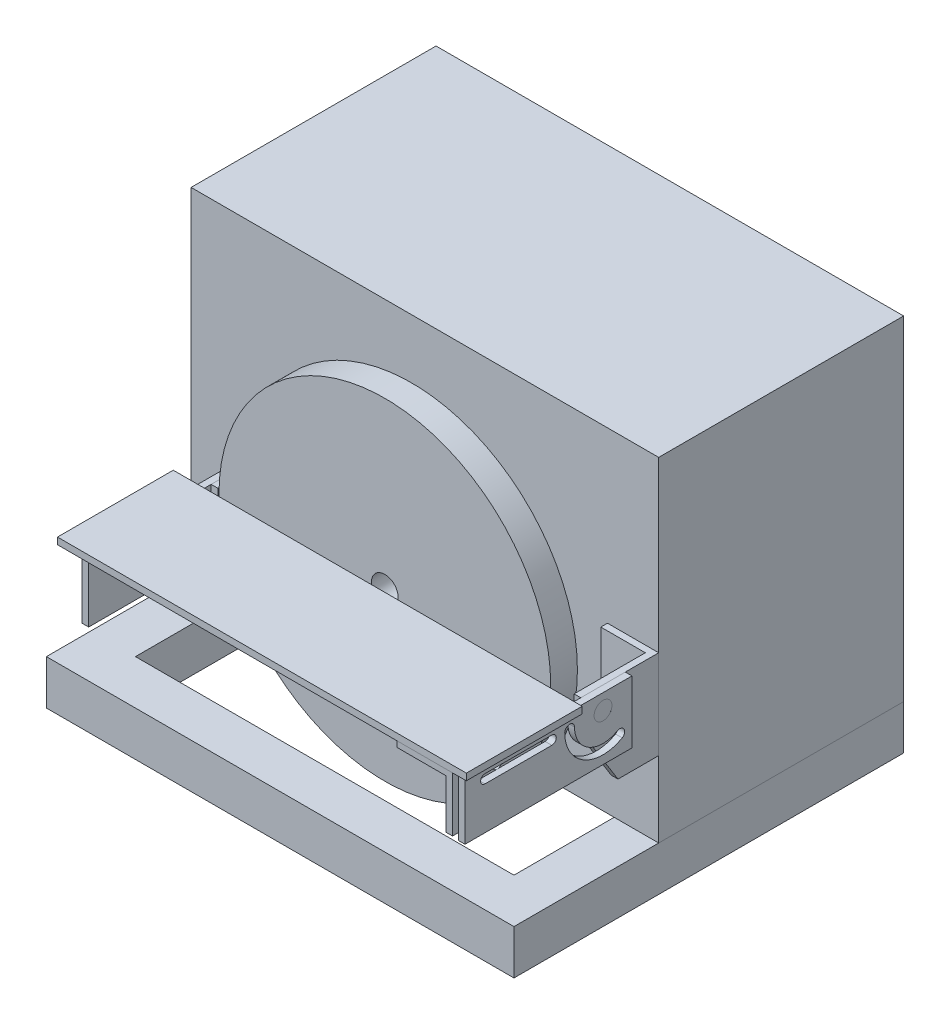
ISO-10303-21;
HEADER;
FILE_DESCRIPTION(('STEP AP214'),'2;1');
FILE_NAME('part.step','',(''),(''),'','','');
FILE_SCHEMA(('AUTOMOTIVE_DESIGN { 1 0 10303 214 1 1 1 1 }'));
ENDSEC;
DATA;
#1=APPLICATION_CONTEXT('core data for automotive mechanical design processes');
#2=APPLICATION_PROTOCOL_DEFINITION('international standard','automotive_design',2000,#1);
#3=PRODUCT_CONTEXT('',#1,'mechanical');
#4=PRODUCT('Part','Part','',(#3));
#5=PRODUCT_RELATED_PRODUCT_CATEGORY('part','',(#4));
#6=PRODUCT_DEFINITION_FORMATION('','',#4);
#7=PRODUCT_DEFINITION_CONTEXT('part definition',#1,'design');
#8=PRODUCT_DEFINITION('design','',#6,#7);
#9=PRODUCT_DEFINITION_SHAPE('','',#8);
#10=(LENGTH_UNIT() NAMED_UNIT(*) SI_UNIT(.MILLI.,.METRE.));
#11=(NAMED_UNIT(*) PLANE_ANGLE_UNIT() SI_UNIT($,.RADIAN.));
#12=(NAMED_UNIT(*) SI_UNIT($,.STERADIAN.) SOLID_ANGLE_UNIT());
#13=UNCERTAINTY_MEASURE_WITH_UNIT(LENGTH_MEASURE(1.E-05),#10,'distance_accuracy_value','');
#14=(GEOMETRIC_REPRESENTATION_CONTEXT(3) GLOBAL_UNCERTAINTY_ASSIGNED_CONTEXT((#13)) GLOBAL_UNIT_ASSIGNED_CONTEXT((#10,
#11,#12)) REPRESENTATION_CONTEXT('',''));
#15=CARTESIAN_POINT('',(0.,0.,0.));
#16=DIRECTION('',(0.,0.,1.));
#17=DIRECTION('',(1.,0.,0.));
#18=AXIS2_PLACEMENT_3D('',#15,#16,#17);
#19=CARTESIAN_POINT('',(111.610966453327,94.,63.5));
#20=DIRECTION('',(-1.,0.,0.));
#21=DIRECTION('',(0.,0.,1.));
#22=AXIS2_PLACEMENT_3D('',#19,#20,#21);
#23=PLANE('',#22);
#24=DIRECTION('',(0.,0.,1.));
#25=VECTOR('',#24,1.);
#26=CARTESIAN_POINT('',(111.610966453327,97.,63.5));
#27=LINE('',#26,#25);
#28=CARTESIAN_POINT('',(111.610966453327,97.,63.5));
#29=VERTEX_POINT('',#28);
#30=CARTESIAN_POINT('',(111.610966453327,97.,115.5));
#31=VERTEX_POINT('',#30);
#32=EDGE_CURVE('E106',#29,#31,#27,.T.);
#33=ORIENTED_EDGE('',*,*,#32,.T.);
#34=DIRECTION('',(0.,1.,0.));
#35=VECTOR('',#34,1.);
#36=CARTESIAN_POINT('',(111.610966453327,94.,115.5));
#37=LINE('',#36,#35);
#38=CARTESIAN_POINT('',(111.610966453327,94.,115.5));
#39=VERTEX_POINT('',#38);
#40=EDGE_CURVE('E60',#39,#31,#37,.T.);
#41=ORIENTED_EDGE('',*,*,#40,.F.);
#42=DIRECTION('',(0.,0.,1.));
#43=VECTOR('',#42,1.);
#44=CARTESIAN_POINT('',(111.610966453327,94.,63.5));
#45=LINE('',#44,#43);
#46=CARTESIAN_POINT('',(111.610966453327,94.,63.5));
#47=VERTEX_POINT('',#46);
#48=EDGE_CURVE('E100',#47,#39,#45,.T.);
#49=ORIENTED_EDGE('',*,*,#48,.F.);
#50=DIRECTION('',(0.,1.,0.));
#51=VECTOR('',#50,1.);
#52=CARTESIAN_POINT('',(111.610966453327,94.,63.5));
#53=LINE('',#52,#51);
#54=EDGE_CURVE('E12',#47,#29,#53,.T.);
#55=ORIENTED_EDGE('',*,*,#54,.T.);
#56=EDGE_LOOP('',(#33,#41,#49,#55));
#57=FACE_BOUND('',#56,.T.);
#58=ADVANCED_FACE('F52',(#57),#23,.F.);
#59=CARTESIAN_POINT('',(111.610966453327,94.,115.5));
#60=DIRECTION('',(0.,0.,-1.));
#61=DIRECTION('',(-1.,0.,0.));
#62=AXIS2_PLACEMENT_3D('',#59,#60,#61);
#63=PLANE('',#62);
#64=DIRECTION('',(-1.,0.,0.));
#65=VECTOR('',#64,1.);
#66=CARTESIAN_POINT('',(111.610966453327,97.,115.5));
#67=LINE('',#66,#65);
#68=CARTESIAN_POINT('',(-72.0156283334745,97.,115.5));
#69=VERTEX_POINT('',#68);
#70=EDGE_CURVE('E86',#31,#69,#67,.T.);
#71=ORIENTED_EDGE('',*,*,#70,.T.);
#72=DIRECTION('',(0.,1.,0.));
#73=VECTOR('',#72,1.);
#74=CARTESIAN_POINT('',(-72.0156283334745,94.,115.5));
#75=LINE('',#74,#73);
#76=CARTESIAN_POINT('',(-72.0156283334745,94.,115.5));
#77=VERTEX_POINT('',#76);
#78=EDGE_CURVE('E107',#77,#69,#75,.T.);
#79=ORIENTED_EDGE('',*,*,#78,.F.);
#80=DIRECTION('',(-1.,0.,0.));
#81=VECTOR('',#80,1.);
#82=CARTESIAN_POINT('',(111.610966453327,94.,115.5));
#83=LINE('',#82,#81);
#84=EDGE_CURVE('E104',#39,#77,#83,.T.);
#85=ORIENTED_EDGE('',*,*,#84,.F.);
#86=ORIENTED_EDGE('',*,*,#40,.T.);
#87=EDGE_LOOP('',(#71,#79,#85,#86));
#88=FACE_BOUND('',#87,.T.);
#89=ADVANCED_FACE('F108',(#88),#63,.F.);
#90=CARTESIAN_POINT('',(-72.0156283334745,94.,63.5));
#91=DIRECTION('',(1.,0.,0.));
#92=DIRECTION('',(0.,0.,-1.));
#93=AXIS2_PLACEMENT_3D('',#90,#91,#92);
#94=PLANE('',#93);
#95=DIRECTION('',(0.,0.,-1.));
#96=VECTOR('',#95,1.);
#97=CARTESIAN_POINT('',(-72.0156283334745,97.,63.5));
#98=LINE('',#97,#96);
#99=CARTESIAN_POINT('',(-72.0156283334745,97.,63.5));
#100=VERTEX_POINT('',#99);
#101=EDGE_CURVE('E118',#69,#100,#98,.T.);
#102=ORIENTED_EDGE('',*,*,#101,.T.);
#103=DIRECTION('',(0.,1.,0.));
#104=VECTOR('',#103,1.);
#105=CARTESIAN_POINT('',(-72.0156283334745,94.,63.5));
#106=LINE('',#105,#104);
#107=CARTESIAN_POINT('',(-72.0156283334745,94.,63.5));
#108=VERTEX_POINT('',#107);
#109=EDGE_CURVE('E112',#108,#100,#106,.T.);
#110=ORIENTED_EDGE('',*,*,#109,.F.);
#111=DIRECTION('',(0.,0.,-1.));
#112=VECTOR('',#111,1.);
#113=CARTESIAN_POINT('',(-72.0156283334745,94.,63.5));
#114=LINE('',#113,#112);
#115=EDGE_CURVE('E110',#77,#108,#114,.T.);
#116=ORIENTED_EDGE('',*,*,#115,.F.);
#117=ORIENTED_EDGE('',*,*,#78,.T.);
#118=EDGE_LOOP('',(#102,#110,#116,#117));
#119=FACE_BOUND('',#118,.T.);
#120=ADVANCED_FACE('F123',(#119),#94,.F.);
#121=CARTESIAN_POINT('',(97.5,94.,63.5));
#122=DIRECTION('',(0.,0.,1.));
#123=DIRECTION('',(1.,0.,0.));
#124=AXIS2_PLACEMENT_3D('',#121,#122,#123);
#125=PLANE('',#124);
#126=DIRECTION('',(1.,0.,0.));
#127=VECTOR('',#126,1.);
#128=CARTESIAN_POINT('',(97.5,97.,63.5));
#129=LINE('',#128,#127);
#130=EDGE_CURVE('E93',#100,#29,#129,.T.);
#131=ORIENTED_EDGE('',*,*,#130,.T.);
#132=ORIENTED_EDGE('',*,*,#54,.F.);
#133=DIRECTION('',(1.,0.,0.));
#134=VECTOR('',#133,1.);
#135=CARTESIAN_POINT('',(97.5,94.,63.5));
#136=LINE('',#135,#134);
#137=EDGE_CURVE('E68',#108,#47,#136,.T.);
#138=ORIENTED_EDGE('',*,*,#137,.F.);
#139=ORIENTED_EDGE('',*,*,#109,.T.);
#140=EDGE_LOOP('',(#131,#132,#138,#139));
#141=FACE_BOUND('',#140,.T.);
#142=ADVANCED_FACE('F126',(#141),#125,.F.);
#143=CARTESIAN_POINT('',(0.,94.,0.));
#144=DIRECTION('',(0.,-1.,0.));
#145=DIRECTION('',(0.,0.,-1.));
#146=AXIS2_PLACEMENT_3D('',#143,#144,#145);
#147=PLANE('',#146);
#148=ORIENTED_EDGE('',*,*,#137,.T.);
#149=ORIENTED_EDGE('',*,*,#48,.T.);
#150=ORIENTED_EDGE('',*,*,#84,.T.);
#151=ORIENTED_EDGE('',*,*,#115,.T.);
#152=EDGE_LOOP('',(#148,#149,#150,#151));
#153=FACE_BOUND('',#152,.T.);
#154=ADVANCED_FACE('F102',(#153),#147,.T.);
#155=CARTESIAN_POINT('',(0.,97.,0.));
#156=DIRECTION('',(0.,-1.,0.));
#157=DIRECTION('',(0.,0.,-1.));
#158=AXIS2_PLACEMENT_3D('',#155,#156,#157);
#159=PLANE('',#158);
#160=ORIENTED_EDGE('',*,*,#32,.F.);
#161=ORIENTED_EDGE('',*,*,#130,.F.);
#162=ORIENTED_EDGE('',*,*,#101,.F.);
#163=ORIENTED_EDGE('',*,*,#70,.F.);
#164=EDGE_LOOP('',(#160,#161,#162,#163));
#165=FACE_BOUND('',#164,.T.);
#166=ADVANCED_FACE('F125',(#165),#159,.F.);
#167=CLOSED_SHELL('',(#58,#89,#120,#142,#154,#166));
#168=MANIFOLD_SOLID_BREP('B2',#167);
#169=CARTESIAN_POINT('',(80.,91.,0.));
#170=DIRECTION('',(-1.,0.,0.));
#171=DIRECTION('',(0.,0.,1.));
#172=AXIS2_PLACEMENT_3D('',#169,#170,#171);
#173=PLANE('',#172);
#174=DIRECTION('',(0.,0.,1.));
#175=VECTOR('',#174,1.);
#176=CARTESIAN_POINT('',(80.,94.,0.));
#177=LINE('',#176,#175);
#178=CARTESIAN_POINT('',(80.,94.,75.0847246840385));
#179=VERTEX_POINT('',#178);
#180=CARTESIAN_POINT('',(80.,94.,115.084724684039));
#181=VERTEX_POINT('',#180);
#182=EDGE_CURVE('E234',#179,#181,#177,.T.);
#183=ORIENTED_EDGE('',*,*,#182,.F.);
#184=DIRECTION('',(0.,1.,0.));
#185=VECTOR('',#184,1.);
#186=CARTESIAN_POINT('',(80.,91.,75.0847246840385));
#187=LINE('',#186,#185);
#188=CARTESIAN_POINT('',(80.,91.,75.0847246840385));
#189=VERTEX_POINT('',#188);
#190=EDGE_CURVE('E50',#189,#179,#187,.T.);
#191=ORIENTED_EDGE('',*,*,#190,.F.);
#192=DIRECTION('',(0.,0.,1.));
#193=VECTOR('',#192,1.);
#194=CARTESIAN_POINT('',(80.,91.,0.));
#195=LINE('',#194,#193);
#196=CARTESIAN_POINT('',(80.,91.,115.084724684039));
#197=VERTEX_POINT('',#196);
#198=EDGE_CURVE('E236',#189,#197,#195,.T.);
#199=ORIENTED_EDGE('',*,*,#198,.T.);
#200=DIRECTION('',(0.,1.,0.));
#201=VECTOR('',#200,1.);
#202=CARTESIAN_POINT('',(80.,91.,115.084724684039));
#203=LINE('',#202,#201);
#204=EDGE_CURVE('E230',#197,#181,#203,.T.);
#205=ORIENTED_EDGE('',*,*,#204,.T.);
#206=EDGE_LOOP('',(#183,#191,#199,#205));
#207=FACE_BOUND('',#206,.T.);
#208=ADVANCED_FACE('F192',(#207),#173,.T.);
#209=CARTESIAN_POINT('',(0.,91.,75.0847246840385));
#210=DIRECTION('',(0.,0.,-1.));
#211=DIRECTION('',(-1.,0.,0.));
#212=AXIS2_PLACEMENT_3D('',#209,#210,#211);
#213=PLANE('',#212);
#214=DIRECTION('',(-1.,0.,0.));
#215=VECTOR('',#214,1.);
#216=CARTESIAN_POINT('',(0.,94.,75.0847246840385));
#217=LINE('',#216,#215);
#218=CARTESIAN_POINT('',(105.,94.,75.0847246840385));
#219=VERTEX_POINT('',#218);
#220=EDGE_CURVE('E252',#219,#179,#217,.T.);
#221=ORIENTED_EDGE('',*,*,#220,.F.);
#222=DIRECTION('',(0.,1.,0.));
#223=VECTOR('',#222,1.);
#224=CARTESIAN_POINT('',(105.,91.,75.0847246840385));
#225=LINE('',#224,#223);
#226=CARTESIAN_POINT('',(105.,69.,75.0847246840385));
#227=VERTEX_POINT('',#226);
#228=EDGE_CURVE('E199',#227,#219,#225,.T.);
#229=ORIENTED_EDGE('',*,*,#228,.F.);
#230=DIRECTION('',(1.,0.,0.));
#231=VECTOR('',#230,1.);
#232=CARTESIAN_POINT('',(105.,69.,75.0847246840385));
#233=LINE('',#232,#231);
#234=CARTESIAN_POINT('',(102.,69.,75.0847246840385));
#235=VERTEX_POINT('',#234);
#236=EDGE_CURVE('E280',#235,#227,#233,.T.);
#237=ORIENTED_EDGE('',*,*,#236,.F.);
#238=DIRECTION('',(0.,1.,0.));
#239=VECTOR('',#238,1.);
#240=CARTESIAN_POINT('',(102.,69.,75.0847246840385));
#241=LINE('',#240,#239);
#242=CARTESIAN_POINT('',(102.,91.,75.0847246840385));
#243=VERTEX_POINT('',#242);
#244=EDGE_CURVE('E257',#235,#243,#241,.T.);
#245=ORIENTED_EDGE('',*,*,#244,.T.);
#246=DIRECTION('',(-1.,0.,0.));
#247=VECTOR('',#246,1.);
#248=CARTESIAN_POINT('',(0.,91.,75.0847246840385));
#249=LINE('',#248,#247);
#250=EDGE_CURVE('E274',#243,#189,#249,.T.);
#251=ORIENTED_EDGE('',*,*,#250,.T.);
#252=ORIENTED_EDGE('',*,*,#190,.T.);
#253=EDGE_LOOP('',(#221,#229,#237,#245,#251,#252));
#254=FACE_BOUND('',#253,.T.);
#255=ADVANCED_FACE('F272',(#254),#213,.T.);
#256=CARTESIAN_POINT('',(105.,91.,0.));
#257=DIRECTION('',(-1.,0.,0.));
#258=DIRECTION('',(0.,0.,1.));
#259=AXIS2_PLACEMENT_3D('',#256,#257,#258);
#260=PLANE('',#259);
#261=CARTESIAN_POINT('',(105.,87.,95.0847246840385));
#262=DIRECTION('',(-1.,0.,0.));
#263=DIRECTION('',(0.,0.,1.));
#264=AXIS2_PLACEMENT_3D('',#261,#262,#263);
#265=CIRCLE('',#264,2.);
#266=CARTESIAN_POINT('',(105.,87.,97.0847246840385));
#267=VERTEX_POINT('',#266);
#268=EDGE_CURVE('E282',#267,#267,#265,.F.);
#269=ORIENTED_EDGE('',*,*,#268,.F.);
#270=EDGE_LOOP('',(#269));
#271=FACE_BOUND('',#270,.T.);
#272=DIRECTION('',(0.,0.,1.));
#273=VECTOR('',#272,1.);
#274=CARTESIAN_POINT('',(105.,94.,0.));
#275=LINE('',#274,#273);
#276=CARTESIAN_POINT('',(105.,94.,115.084724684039));
#277=VERTEX_POINT('',#276);
#278=EDGE_CURVE('E248',#219,#277,#275,.T.);
#279=ORIENTED_EDGE('',*,*,#278,.T.);
#280=DIRECTION('',(0.,1.,0.));
#281=VECTOR('',#280,1.);
#282=CARTESIAN_POINT('',(105.,91.,115.084724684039));
#283=LINE('',#282,#281);
#284=CARTESIAN_POINT('',(105.,69.,115.084724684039));
#285=VERTEX_POINT('',#284);
#286=EDGE_CURVE('E238',#285,#277,#283,.T.);
#287=ORIENTED_EDGE('',*,*,#286,.F.);
#288=DIRECTION('',(0.,0.,1.));
#289=VECTOR('',#288,1.);
#290=CARTESIAN_POINT('',(105.,69.,75.0847246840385));
#291=LINE('',#290,#289);
#292=EDGE_CURVE('E268',#227,#285,#291,.T.);
#293=ORIENTED_EDGE('',*,*,#292,.F.);
#294=ORIENTED_EDGE('',*,*,#228,.T.);
#295=EDGE_LOOP('',(#279,#287,#293,#294));
#296=FACE_BOUND('',#295,.T.);
#297=ADVANCED_FACE('F266',(#271,#296),#260,.F.);
#298=CARTESIAN_POINT('',(0.,91.,115.084724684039));
#299=DIRECTION('',(0.,0.,-1.));
#300=DIRECTION('',(-1.,0.,0.));
#301=AXIS2_PLACEMENT_3D('',#298,#299,#300);
#302=PLANE('',#301);
#303=DIRECTION('',(-1.,0.,0.));
#304=VECTOR('',#303,1.);
#305=CARTESIAN_POINT('',(0.,94.,115.084724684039));
#306=LINE('',#305,#304);
#307=EDGE_CURVE('E242',#277,#181,#306,.T.);
#308=ORIENTED_EDGE('',*,*,#307,.T.);
#309=ORIENTED_EDGE('',*,*,#204,.F.);
#310=DIRECTION('',(-1.,0.,0.));
#311=VECTOR('',#310,1.);
#312=CARTESIAN_POINT('',(0.,91.,115.084724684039));
#313=LINE('',#312,#311);
#314=CARTESIAN_POINT('',(102.,91.,115.084724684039));
#315=VERTEX_POINT('',#314);
#316=EDGE_CURVE('E211',#315,#197,#313,.T.);
#317=ORIENTED_EDGE('',*,*,#316,.F.);
#318=DIRECTION('',(0.,1.,0.));
#319=VECTOR('',#318,1.);
#320=CARTESIAN_POINT('',(102.,69.,115.084724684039));
#321=LINE('',#320,#319);
#322=CARTESIAN_POINT('',(102.,69.,115.084724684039));
#323=VERTEX_POINT('',#322);
#324=EDGE_CURVE('E253',#323,#315,#321,.T.);
#325=ORIENTED_EDGE('',*,*,#324,.F.);
#326=DIRECTION('',(-1.,0.,0.));
#327=VECTOR('',#326,1.);
#328=CARTESIAN_POINT('',(105.,69.,115.084724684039));
#329=LINE('',#328,#327);
#330=EDGE_CURVE('E287',#285,#323,#329,.T.);
#331=ORIENTED_EDGE('',*,*,#330,.F.);
#332=ORIENTED_EDGE('',*,*,#286,.T.);
#333=EDGE_LOOP('',(#308,#309,#317,#325,#331,#332));
#334=FACE_BOUND('',#333,.T.);
#335=ADVANCED_FACE('F243',(#334),#302,.F.);
#336=CARTESIAN_POINT('',(0.,91.,0.));
#337=DIRECTION('',(0.,-1.,0.));
#338=DIRECTION('',(0.,0.,-1.));
#339=AXIS2_PLACEMENT_3D('',#336,#337,#338);
#340=PLANE('',#339);
#341=DIRECTION('',(0.,0.,-1.));
#342=VECTOR('',#341,1.);
#343=CARTESIAN_POINT('',(102.,91.,75.0847246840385));
#344=LINE('',#343,#342);
#345=EDGE_CURVE('E206',#315,#243,#344,.T.);
#346=ORIENTED_EDGE('',*,*,#345,.F.);
#347=ORIENTED_EDGE('',*,*,#316,.T.);
#348=ORIENTED_EDGE('',*,*,#198,.F.);
#349=ORIENTED_EDGE('',*,*,#250,.F.);
#350=EDGE_LOOP('',(#346,#347,#348,#349));
#351=FACE_BOUND('',#350,.T.);
#352=ADVANCED_FACE('F275',(#351),#340,.T.);
#353=CARTESIAN_POINT('',(0.,94.,0.));
#354=DIRECTION('',(0.,-1.,0.));
#355=DIRECTION('',(0.,0.,-1.));
#356=AXIS2_PLACEMENT_3D('',#353,#354,#355);
#357=PLANE('',#356);
#358=ORIENTED_EDGE('',*,*,#182,.T.);
#359=ORIENTED_EDGE('',*,*,#307,.F.);
#360=ORIENTED_EDGE('',*,*,#278,.F.);
#361=ORIENTED_EDGE('',*,*,#220,.T.);
#362=EDGE_LOOP('',(#358,#359,#360,#361));
#363=FACE_BOUND('',#362,.T.);
#364=ADVANCED_FACE('F250',(#363),#357,.F.);
#365=CARTESIAN_POINT('',(102.,69.,75.0847246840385));
#366=DIRECTION('',(1.,0.,0.));
#367=DIRECTION('',(0.,0.,-1.));
#368=AXIS2_PLACEMENT_3D('',#365,#366,#367);
#369=PLANE('',#368);
#370=CARTESIAN_POINT('',(102.,87.,95.0847246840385));
#371=DIRECTION('',(-1.,0.,0.));
#372=DIRECTION('',(0.,0.,1.));
#373=AXIS2_PLACEMENT_3D('',#370,#371,#372);
#374=CIRCLE('',#373,2.);
#375=CARTESIAN_POINT('',(102.,87.,97.0847246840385));
#376=VERTEX_POINT('',#375);
#377=EDGE_CURVE('E293',#376,#376,#374,.T.);
#378=ORIENTED_EDGE('',*,*,#377,.F.);
#379=EDGE_LOOP('',(#378));
#380=FACE_BOUND('',#379,.T.);
#381=ORIENTED_EDGE('',*,*,#345,.T.);
#382=ORIENTED_EDGE('',*,*,#244,.F.);
#383=DIRECTION('',(0.,0.,-1.));
#384=VECTOR('',#383,1.);
#385=CARTESIAN_POINT('',(102.,69.,75.0847246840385));
#386=LINE('',#385,#384);
#387=EDGE_CURVE('E284',#323,#235,#386,.T.);
#388=ORIENTED_EDGE('',*,*,#387,.F.);
#389=ORIENTED_EDGE('',*,*,#324,.T.);
#390=EDGE_LOOP('',(#381,#382,#388,#389));
#391=FACE_BOUND('',#390,.T.);
#392=ADVANCED_FACE('F300',(#380,#391),#369,.F.);
#393=CARTESIAN_POINT('',(0.,69.,0.));
#394=DIRECTION('',(0.,-1.,0.));
#395=DIRECTION('',(0.,0.,-1.));
#396=AXIS2_PLACEMENT_3D('',#393,#394,#395);
#397=PLANE('',#396);
#398=ORIENTED_EDGE('',*,*,#292,.T.);
#399=ORIENTED_EDGE('',*,*,#330,.T.);
#400=ORIENTED_EDGE('',*,*,#387,.T.);
#401=ORIENTED_EDGE('',*,*,#236,.T.);
#402=EDGE_LOOP('',(#398,#399,#400,#401));
#403=FACE_BOUND('',#402,.T.);
#404=ADVANCED_FACE('F303',(#403),#397,.T.);
#405=CARTESIAN_POINT('',(111.611966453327,87.,95.0847246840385));
#406=DIRECTION('',(-1.,0.,0.));
#407=DIRECTION('',(0.,0.,1.));
#408=AXIS2_PLACEMENT_3D('',#405,#406,#407);
#409=CYLINDRICAL_SURFACE('',#408,2.);
#410=ORIENTED_EDGE('',*,*,#377,.T.);
#411=EDGE_LOOP('',(#410));
#412=FACE_BOUND('',#411,.T.);
#413=ORIENTED_EDGE('',*,*,#268,.T.);
#414=EDGE_LOOP('',(#413));
#415=FACE_BOUND('',#414,.T.);
#416=ADVANCED_FACE('F297',(#412,#415),#409,.F.);
#417=CLOSED_SHELL('',(#208,#255,#297,#335,#352,#364,#392,#404,#416));
#418=MANIFOLD_SOLID_BREP('B6',#417);
#419=CARTESIAN_POINT('',(84.9999999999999,20.,0.));
#420=DIRECTION('',(-1.,0.,0.));
#421=DIRECTION('',(0.,0.,1.));
#422=AXIS2_PLACEMENT_3D('',#419,#420,#421);
#423=PLANE('',#422);
#424=DIRECTION('',(0.,0.,-1.));
#425=VECTOR('',#424,1.);
#426=CARTESIAN_POINT('',(84.9999999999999,0.,0.));
#427=LINE('',#426,#425);
#428=CARTESIAN_POINT('',(85.,0.,67.5));
#429=VERTEX_POINT('',#428);
#430=CARTESIAN_POINT('',(85.,0.,-87.5));
#431=VERTEX_POINT('',#430);
#432=EDGE_CURVE('E506',#429,#431,#427,.T.);
#433=ORIENTED_EDGE('',*,*,#432,.F.);
#434=DIRECTION('',(0.,-1.,0.));
#435=VECTOR('',#434,1.);
#436=CARTESIAN_POINT('',(85.,20.,67.5));
#437=LINE('',#436,#435);
#438=CARTESIAN_POINT('',(85.,20.,67.5));
#439=VERTEX_POINT('',#438);
#440=EDGE_CURVE('E190',#439,#429,#437,.T.);
#441=ORIENTED_EDGE('',*,*,#440,.F.);
#442=DIRECTION('',(0.,0.,-1.));
#443=VECTOR('',#442,1.);
#444=CARTESIAN_POINT('',(84.9999999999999,20.,0.));
#445=LINE('',#444,#443);
#446=CARTESIAN_POINT('',(85.,20.,-87.5));
#447=VERTEX_POINT('',#446);
#448=EDGE_CURVE('E549',#439,#447,#445,.T.);
#449=ORIENTED_EDGE('',*,*,#448,.T.);
#450=DIRECTION('',(0.,-1.,0.));
#451=VECTOR('',#450,1.);
#452=CARTESIAN_POINT('',(85.,20.,-87.5));
#453=LINE('',#452,#451);
#454=EDGE_CURVE('E427',#447,#431,#453,.T.);
#455=ORIENTED_EDGE('',*,*,#454,.T.);
#456=EDGE_LOOP('',(#433,#441,#449,#455));
#457=FACE_BOUND('',#456,.T.);
#458=ADVANCED_FACE('F411',(#457),#423,.T.);
#459=CARTESIAN_POINT('',(0.,20.,67.5));
#460=DIRECTION('',(0.,0.,-1.));
#461=DIRECTION('',(-1.,0.,0.));
#462=AXIS2_PLACEMENT_3D('',#459,#460,#461);
#463=PLANE('',#462);
#464=DIRECTION('',(1.,0.,0.));
#465=VECTOR('',#464,1.);
#466=CARTESIAN_POINT('',(0.,0.,67.5));
#467=LINE('',#466,#465);
#468=CARTESIAN_POINT('',(-85.,0.,67.5));
#469=VERTEX_POINT('',#468);
#470=EDGE_CURVE('E508',#469,#429,#467,.T.);
#471=ORIENTED_EDGE('',*,*,#470,.F.);
#472=DIRECTION('',(0.,-1.,0.));
#473=VECTOR('',#472,1.);
#474=CARTESIAN_POINT('',(-85.,20.,67.5));
#475=LINE('',#474,#473);
#476=CARTESIAN_POINT('',(-85.,20.,67.5));
#477=VERTEX_POINT('',#476);
#478=EDGE_CURVE('E419',#477,#469,#475,.T.);
#479=ORIENTED_EDGE('',*,*,#478,.F.);
#480=DIRECTION('',(1.,0.,0.));
#481=VECTOR('',#480,1.);
#482=CARTESIAN_POINT('',(0.,20.,67.5));
#483=LINE('',#482,#481);
#484=EDGE_CURVE('E547',#477,#439,#483,.T.);
#485=ORIENTED_EDGE('',*,*,#484,.T.);
#486=ORIENTED_EDGE('',*,*,#440,.T.);
#487=EDGE_LOOP('',(#471,#479,#485,#486));
#488=FACE_BOUND('',#487,.T.);
#489=ADVANCED_FACE('F539',(#488),#463,.T.);
#490=CARTESIAN_POINT('',(-85.,20.,0.));
#491=DIRECTION('',(1.,0.,0.));
#492=DIRECTION('',(0.,0.,-1.));
#493=AXIS2_PLACEMENT_3D('',#490,#491,#492);
#494=PLANE('',#493);
#495=DIRECTION('',(0.,0.,1.));
#496=VECTOR('',#495,1.);
#497=CARTESIAN_POINT('',(-85.,0.,0.));
#498=LINE('',#497,#496);
#499=CARTESIAN_POINT('',(-85.,0.,-87.5));
#500=VERTEX_POINT('',#499);
#501=EDGE_CURVE('E511',#500,#469,#498,.T.);
#502=ORIENTED_EDGE('',*,*,#501,.F.);
#503=DIRECTION('',(0.,-1.,0.));
#504=VECTOR('',#503,1.);
#505=CARTESIAN_POINT('',(-85.,20.,-87.5));
#506=LINE('',#505,#504);
#507=CARTESIAN_POINT('',(-85.,20.,-87.5));
#508=VERTEX_POINT('',#507);
#509=EDGE_CURVE('E528',#508,#500,#506,.T.);
#510=ORIENTED_EDGE('',*,*,#509,.F.);
#511=DIRECTION('',(0.,0.,1.));
#512=VECTOR('',#511,1.);
#513=CARTESIAN_POINT('',(-85.,20.,0.));
#514=LINE('',#513,#512);
#515=EDGE_CURVE('E535',#508,#477,#514,.T.);
#516=ORIENTED_EDGE('',*,*,#515,.T.);
#517=ORIENTED_EDGE('',*,*,#478,.T.);
#518=EDGE_LOOP('',(#502,#510,#516,#517));
#519=FACE_BOUND('',#518,.T.);
#520=ADVANCED_FACE('F533',(#519),#494,.T.);
#521=CARTESIAN_POINT('',(0.,20.,-87.5));
#522=DIRECTION('',(0.,0.,-1.));
#523=DIRECTION('',(-1.,0.,0.));
#524=AXIS2_PLACEMENT_3D('',#521,#522,#523);
#525=PLANE('',#524);
#526=DIRECTION('',(1.,0.,0.));
#527=VECTOR('',#526,1.);
#528=CARTESIAN_POINT('',(0.,0.,-87.5));
#529=LINE('',#528,#527);
#530=CARTESIAN_POINT('',(-105.,0.,-87.5));
#531=VERTEX_POINT('',#530);
#532=EDGE_CURVE('E514',#531,#500,#529,.T.);
#533=ORIENTED_EDGE('',*,*,#532,.F.);
#534=DIRECTION('',(0.,-1.,0.));
#535=VECTOR('',#534,1.);
#536=CARTESIAN_POINT('',(-105.,20.,-87.5));
#537=LINE('',#536,#535);
#538=CARTESIAN_POINT('',(-105.,20.,-87.5));
#539=VERTEX_POINT('',#538);
#540=EDGE_CURVE('E526',#539,#531,#537,.T.);
#541=ORIENTED_EDGE('',*,*,#540,.F.);
#542=DIRECTION('',(1.,0.,0.));
#543=VECTOR('',#542,1.);
#544=CARTESIAN_POINT('',(0.,20.,-87.5));
#545=LINE('',#544,#543);
#546=EDGE_CURVE('E503',#539,#508,#545,.T.);
#547=ORIENTED_EDGE('',*,*,#546,.T.);
#548=ORIENTED_EDGE('',*,*,#509,.T.);
#549=EDGE_LOOP('',(#533,#541,#547,#548));
#550=FACE_BOUND('',#549,.T.);
#551=ADVANCED_FACE('F545',(#550),#525,.T.);
#552=CARTESIAN_POINT('',(-105.,20.,0.));
#553=DIRECTION('',(1.,0.,0.));
#554=DIRECTION('',(0.,0.,-1.));
#555=AXIS2_PLACEMENT_3D('',#552,#553,#554);
#556=PLANE('',#555);
#557=DIRECTION('',(0.,0.,1.));
#558=VECTOR('',#557,1.);
#559=CARTESIAN_POINT('',(-105.,0.,0.));
#560=LINE('',#559,#558);
#561=CARTESIAN_POINT('',(-105.,0.,87.5));
#562=VERTEX_POINT('',#561);
#563=EDGE_CURVE('E517',#531,#562,#560,.T.);
#564=ORIENTED_EDGE('',*,*,#563,.T.);
#565=DIRECTION('',(0.,-1.,0.));
#566=VECTOR('',#565,1.);
#567=CARTESIAN_POINT('',(-105.,20.,87.5));
#568=LINE('',#567,#566);
#569=CARTESIAN_POINT('',(-105.,20.,87.5));
#570=VERTEX_POINT('',#569);
#571=EDGE_CURVE('E497',#570,#562,#568,.T.);
#572=ORIENTED_EDGE('',*,*,#571,.F.);
#573=DIRECTION('',(0.,0.,1.));
#574=VECTOR('',#573,1.);
#575=CARTESIAN_POINT('',(-105.,20.,0.));
#576=LINE('',#575,#574);
#577=EDGE_CURVE('E485',#539,#570,#576,.T.);
#578=ORIENTED_EDGE('',*,*,#577,.F.);
#579=ORIENTED_EDGE('',*,*,#540,.T.);
#580=EDGE_LOOP('',(#564,#572,#578,#579));
#581=FACE_BOUND('',#580,.T.);
#582=ADVANCED_FACE('F564',(#581),#556,.F.);
#583=CARTESIAN_POINT('',(0.,20.,87.5));
#584=DIRECTION('',(0.,0.,-1.));
#585=DIRECTION('',(-1.,0.,0.));
#586=AXIS2_PLACEMENT_3D('',#583,#584,#585);
#587=PLANE('',#586);
#588=DIRECTION('',(1.,0.,0.));
#589=VECTOR('',#588,1.);
#590=CARTESIAN_POINT('',(0.,0.,87.5));
#591=LINE('',#590,#589);
#592=CARTESIAN_POINT('',(105.,0.,87.5));
#593=VERTEX_POINT('',#592);
#594=EDGE_CURVE('E494',#562,#593,#591,.T.);
#595=ORIENTED_EDGE('',*,*,#594,.T.);
#596=DIRECTION('',(0.,-1.,0.));
#597=VECTOR('',#596,1.);
#598=CARTESIAN_POINT('',(105.,20.,87.5));
#599=LINE('',#598,#597);
#600=CARTESIAN_POINT('',(105.,20.,87.5));
#601=VERTEX_POINT('',#600);
#602=EDGE_CURVE('E491',#601,#593,#599,.T.);
#603=ORIENTED_EDGE('',*,*,#602,.F.);
#604=DIRECTION('',(1.,0.,0.));
#605=VECTOR('',#604,1.);
#606=CARTESIAN_POINT('',(0.,20.,87.5));
#607=LINE('',#606,#605);
#608=EDGE_CURVE('E477',#570,#601,#607,.T.);
#609=ORIENTED_EDGE('',*,*,#608,.F.);
#610=ORIENTED_EDGE('',*,*,#571,.T.);
#611=EDGE_LOOP('',(#595,#603,#609,#610));
#612=FACE_BOUND('',#611,.T.);
#613=ADVANCED_FACE('F492',(#612),#587,.F.);
#614=CARTESIAN_POINT('',(105.,20.,0.));
#615=DIRECTION('',(1.,0.,0.));
#616=DIRECTION('',(0.,0.,-1.));
#617=AXIS2_PLACEMENT_3D('',#614,#615,#616);
#618=PLANE('',#617);
#619=DIRECTION('',(0.,0.,1.));
#620=VECTOR('',#619,1.);
#621=CARTESIAN_POINT('',(105.,0.,0.));
#622=LINE('',#621,#620);
#623=CARTESIAN_POINT('',(105.,0.,-87.5));
#624=VERTEX_POINT('',#623);
#625=EDGE_CURVE('E521',#624,#593,#622,.T.);
#626=ORIENTED_EDGE('',*,*,#625,.F.);
#627=DIRECTION('',(0.,-1.,0.));
#628=VECTOR('',#627,1.);
#629=CARTESIAN_POINT('',(105.,20.,-87.5));
#630=LINE('',#629,#628);
#631=CARTESIAN_POINT('',(105.,20.,-87.5));
#632=VERTEX_POINT('',#631);
#633=EDGE_CURVE('E452',#632,#624,#630,.T.);
#634=ORIENTED_EDGE('',*,*,#633,.F.);
#635=DIRECTION('',(0.,0.,1.));
#636=VECTOR('',#635,1.);
#637=CARTESIAN_POINT('',(105.,20.,0.));
#638=LINE('',#637,#636);
#639=EDGE_CURVE('E482',#632,#601,#638,.T.);
#640=ORIENTED_EDGE('',*,*,#639,.T.);
#641=ORIENTED_EDGE('',*,*,#602,.T.);
#642=EDGE_LOOP('',(#626,#634,#640,#641));
#643=FACE_BOUND('',#642,.T.);
#644=ADVANCED_FACE('F499',(#643),#618,.T.);
#645=EDGE_CURVE('E518',#431,#624,#529,.T.);
#646=ORIENTED_EDGE('',*,*,#645,.F.);
#647=ORIENTED_EDGE('',*,*,#454,.F.);
#648=EDGE_CURVE('E500',#447,#632,#545,.T.);
#649=ORIENTED_EDGE('',*,*,#648,.T.);
#650=ORIENTED_EDGE('',*,*,#633,.T.);
#651=EDGE_LOOP('',(#646,#647,#649,#650));
#652=FACE_BOUND('',#651,.T.);
#653=ADVANCED_FACE('F553',(#652),#525,.T.);
#654=CARTESIAN_POINT('',(0.,20.,0.));
#655=DIRECTION('',(0.,1.,0.));
#656=DIRECTION('',(0.,0.,1.));
#657=AXIS2_PLACEMENT_3D('',#654,#655,#656);
#658=PLANE('',#657);
#659=ORIENTED_EDGE('',*,*,#448,.F.);
#660=ORIENTED_EDGE('',*,*,#484,.F.);
#661=ORIENTED_EDGE('',*,*,#515,.F.);
#662=ORIENTED_EDGE('',*,*,#546,.F.);
#663=ORIENTED_EDGE('',*,*,#577,.T.);
#664=ORIENTED_EDGE('',*,*,#608,.T.);
#665=ORIENTED_EDGE('',*,*,#639,.F.);
#666=ORIENTED_EDGE('',*,*,#648,.F.);
#667=EDGE_LOOP('',(#659,#660,#661,#662,#663,#664,#665,#666));
#668=FACE_BOUND('',#667,.T.);
#669=ADVANCED_FACE('F479',(#668),#658,.T.);
#670=CARTESIAN_POINT('',(0.,0.,0.));
#671=DIRECTION('',(0.,1.,0.));
#672=DIRECTION('',(0.,0.,1.));
#673=AXIS2_PLACEMENT_3D('',#670,#671,#672);
#674=PLANE('',#673);
#675=ORIENTED_EDGE('',*,*,#432,.T.);
#676=ORIENTED_EDGE('',*,*,#645,.T.);
#677=ORIENTED_EDGE('',*,*,#625,.T.);
#678=ORIENTED_EDGE('',*,*,#594,.F.);
#679=ORIENTED_EDGE('',*,*,#563,.F.);
#680=ORIENTED_EDGE('',*,*,#532,.T.);
#681=ORIENTED_EDGE('',*,*,#501,.T.);
#682=ORIENTED_EDGE('',*,*,#470,.T.);
#683=EDGE_LOOP('',(#675,#676,#677,#678,#679,#680,#681,#682));
#684=FACE_BOUND('',#683,.T.);
#685=ADVANCED_FACE('F541',(#684),#674,.F.);
#686=CLOSED_SHELL('',(#458,#489,#520,#551,#582,#613,#644,#653,#669,#685));
#687=MANIFOLD_SOLID_BREP('B44',#686);
#688=CARTESIAN_POINT('',(22.,97.,50.5));
#689=DIRECTION('',(0.,0.,-1.));
#690=DIRECTION('',(-1.,0.,0.));
#691=AXIS2_PLACEMENT_3D('',#688,#689,#690);
#692=CYLINDRICAL_SURFACE('',#691,4.);
#693=CARTESIAN_POINT('',(22.,97.,22.5));
#694=DIRECTION('',(0.,0.,-1.));
#695=DIRECTION('',(-1.,0.,0.));
#696=AXIS2_PLACEMENT_3D('',#693,#694,#695);
#697=CIRCLE('',#696,4.);
#698=CARTESIAN_POINT('',(18.,97.,22.5));
#699=VERTEX_POINT('',#698);
#700=EDGE_CURVE('E730',#699,#699,#697,.F.);
#701=ORIENTED_EDGE('',*,*,#700,.T.);
#702=EDGE_LOOP('',(#701));
#703=FACE_BOUND('',#702,.T.);
#704=CARTESIAN_POINT('',(22.,97.,45.5));
#705=DIRECTION('',(0.,0.,1.));
#706=DIRECTION('',(1.,0.,0.));
#707=AXIS2_PLACEMENT_3D('',#704,#705,#706);
#708=CIRCLE('',#707,4.);
#709=CARTESIAN_POINT('',(26.,97.,45.5));
#710=VERTEX_POINT('',#709);
#711=EDGE_CURVE('E656',#710,#710,#708,.T.);
#712=ORIENTED_EDGE('',*,*,#711,.F.);
#713=EDGE_LOOP('',(#712));
#714=FACE_BOUND('',#713,.T.);
#715=ADVANCED_FACE('F652',(#703,#714),#692,.T.);
#716=CARTESIAN_POINT('',(-105.,170.,-87.5));
#717=DIRECTION('',(1.,0.,0.));
#718=DIRECTION('',(0.,0.,-1.));
#719=AXIS2_PLACEMENT_3D('',#716,#717,#718);
#720=PLANE('',#719);
#721=DIRECTION('',(0.,0.,1.));
#722=VECTOR('',#721,1.);
#723=CARTESIAN_POINT('',(-105.,20.,-87.5));
#724=LINE('',#723,#722);
#725=CARTESIAN_POINT('',(-105.,20.,-87.5));
#726=VERTEX_POINT('',#725);
#727=CARTESIAN_POINT('',(-105.,20.,22.5));
#728=VERTEX_POINT('',#727);
#729=EDGE_CURVE('E721',#726,#728,#724,.T.);
#730=ORIENTED_EDGE('',*,*,#729,.T.);
#731=DIRECTION('',(0.,-1.,0.));
#732=VECTOR('',#731,1.);
#733=CARTESIAN_POINT('',(-105.,170.,22.5));
#734=LINE('',#733,#732);
#735=CARTESIAN_POINT('',(-105.,170.,22.5));
#736=VERTEX_POINT('',#735);
#737=EDGE_CURVE('E712',#736,#728,#734,.T.);
#738=ORIENTED_EDGE('',*,*,#737,.F.);
#739=DIRECTION('',(0.,0.,1.));
#740=VECTOR('',#739,1.);
#741=CARTESIAN_POINT('',(-105.,170.,-87.5));
#742=LINE('',#741,#740);
#743=CARTESIAN_POINT('',(-105.,170.,-87.5));
#744=VERTEX_POINT('',#743);
#745=EDGE_CURVE('E706',#744,#736,#742,.T.);
#746=ORIENTED_EDGE('',*,*,#745,.F.);
#747=DIRECTION('',(0.,-1.,0.));
#748=VECTOR('',#747,1.);
#749=CARTESIAN_POINT('',(-105.,170.,-87.5));
#750=LINE('',#749,#748);
#751=EDGE_CURVE('E717',#744,#726,#750,.T.);
#752=ORIENTED_EDGE('',*,*,#751,.T.);
#753=EDGE_LOOP('',(#730,#738,#746,#752));
#754=FACE_BOUND('',#753,.T.);
#755=ADVANCED_FACE('F654',(#754),#720,.F.);
#756=CARTESIAN_POINT('',(-105.,170.,22.5));
#757=DIRECTION('',(0.,0.,-1.));
#758=DIRECTION('',(-1.,0.,0.));
#759=AXIS2_PLACEMENT_3D('',#756,#757,#758);
#760=PLANE('',#759);
#761=ORIENTED_EDGE('',*,*,#700,.F.);
#762=EDGE_LOOP('',(#761));
#763=FACE_BOUND('',#762,.T.);
#764=DIRECTION('',(1.,0.,0.));
#765=VECTOR('',#764,1.);
#766=CARTESIAN_POINT('',(-105.,20.,22.5));
#767=LINE('',#766,#765);
#768=CARTESIAN_POINT('',(105.,20.,22.5));
#769=VERTEX_POINT('',#768);
#770=EDGE_CURVE('E711',#728,#769,#767,.T.);
#771=ORIENTED_EDGE('',*,*,#770,.T.);
#772=DIRECTION('',(0.,-1.,0.));
#773=VECTOR('',#772,1.);
#774=CARTESIAN_POINT('',(105.,170.,22.5));
#775=LINE('',#774,#773);
#776=CARTESIAN_POINT('',(105.,170.,22.5));
#777=VERTEX_POINT('',#776);
#778=EDGE_CURVE('E709',#777,#769,#775,.T.);
#779=ORIENTED_EDGE('',*,*,#778,.F.);
#780=DIRECTION('',(1.,0.,0.));
#781=VECTOR('',#780,1.);
#782=CARTESIAN_POINT('',(-105.,170.,22.5));
#783=LINE('',#782,#781);
#784=EDGE_CURVE('E701',#736,#777,#783,.T.);
#785=ORIENTED_EDGE('',*,*,#784,.F.);
#786=ORIENTED_EDGE('',*,*,#737,.T.);
#787=EDGE_LOOP('',(#771,#779,#785,#786));
#788=FACE_BOUND('',#787,.T.);
#789=ADVANCED_FACE('F710',(#763,#788),#760,.F.);
#790=CARTESIAN_POINT('',(105.,170.,-87.5));
#791=DIRECTION('',(-1.,0.,0.));
#792=DIRECTION('',(0.,0.,1.));
#793=AXIS2_PLACEMENT_3D('',#790,#791,#792);
#794=PLANE('',#793);
#795=DIRECTION('',(0.,0.,-1.));
#796=VECTOR('',#795,1.);
#797=CARTESIAN_POINT('',(105.,20.,-87.5));
#798=LINE('',#797,#796);
#799=CARTESIAN_POINT('',(105.,20.,-87.5));
#800=VERTEX_POINT('',#799);
#801=EDGE_CURVE('E687',#769,#800,#798,.T.);
#802=ORIENTED_EDGE('',*,*,#801,.T.);
#803=DIRECTION('',(0.,-1.,0.));
#804=VECTOR('',#803,1.);
#805=CARTESIAN_POINT('',(105.,170.,-87.5));
#806=LINE('',#805,#804);
#807=CARTESIAN_POINT('',(105.,170.,-87.5));
#808=VERTEX_POINT('',#807);
#809=EDGE_CURVE('E713',#808,#800,#806,.T.);
#810=ORIENTED_EDGE('',*,*,#809,.F.);
#811=DIRECTION('',(0.,0.,-1.));
#812=VECTOR('',#811,1.);
#813=CARTESIAN_POINT('',(105.,170.,-87.5));
#814=LINE('',#813,#812);
#815=EDGE_CURVE('E704',#777,#808,#814,.T.);
#816=ORIENTED_EDGE('',*,*,#815,.F.);
#817=ORIENTED_EDGE('',*,*,#778,.T.);
#818=EDGE_LOOP('',(#802,#810,#816,#817));
#819=FACE_BOUND('',#818,.T.);
#820=ADVANCED_FACE('F715',(#819),#794,.F.);
#821=CARTESIAN_POINT('',(-105.,170.,-87.5));
#822=DIRECTION('',(0.,0.,1.));
#823=DIRECTION('',(1.,0.,0.));
#824=AXIS2_PLACEMENT_3D('',#821,#822,#823);
#825=PLANE('',#824);
#826=DIRECTION('',(-1.,0.,0.));
#827=VECTOR('',#826,1.);
#828=CARTESIAN_POINT('',(-105.,20.,-87.5));
#829=LINE('',#828,#827);
#830=EDGE_CURVE('E693',#800,#726,#829,.T.);
#831=ORIENTED_EDGE('',*,*,#830,.T.);
#832=ORIENTED_EDGE('',*,*,#751,.F.);
#833=DIRECTION('',(-1.,0.,0.));
#834=VECTOR('',#833,1.);
#835=CARTESIAN_POINT('',(-105.,170.,-87.5));
#836=LINE('',#835,#834);
#837=EDGE_CURVE('E670',#808,#744,#836,.T.);
#838=ORIENTED_EDGE('',*,*,#837,.F.);
#839=ORIENTED_EDGE('',*,*,#809,.T.);
#840=EDGE_LOOP('',(#831,#832,#838,#839));
#841=FACE_BOUND('',#840,.T.);
#842=ADVANCED_FACE('F753',(#841),#825,.F.);
#843=CARTESIAN_POINT('',(0.,170.,0.));
#844=DIRECTION('',(0.,1.,0.));
#845=DIRECTION('',(0.,0.,1.));
#846=AXIS2_PLACEMENT_3D('',#843,#844,#845);
#847=PLANE('',#846);
#848=ORIENTED_EDGE('',*,*,#745,.T.);
#849=ORIENTED_EDGE('',*,*,#784,.T.);
#850=ORIENTED_EDGE('',*,*,#815,.T.);
#851=ORIENTED_EDGE('',*,*,#837,.T.);
#852=EDGE_LOOP('',(#848,#849,#850,#851));
#853=FACE_BOUND('',#852,.T.);
#854=ADVANCED_FACE('F702',(#853),#847,.T.);
#855=CARTESIAN_POINT('',(0.,20.,0.));
#856=DIRECTION('',(0.,1.,0.));
#857=DIRECTION('',(0.,0.,1.));
#858=AXIS2_PLACEMENT_3D('',#855,#856,#857);
#859=PLANE('',#858);
#860=ORIENTED_EDGE('',*,*,#729,.F.);
#861=ORIENTED_EDGE('',*,*,#830,.F.);
#862=ORIENTED_EDGE('',*,*,#801,.F.);
#863=ORIENTED_EDGE('',*,*,#770,.F.);
#864=EDGE_LOOP('',(#860,#861,#862,#863));
#865=FACE_BOUND('',#864,.T.);
#866=ADVANCED_FACE('F752',(#865),#859,.F.);
#867=CARTESIAN_POINT('',(22.,97.,45.5));
#868=DIRECTION('',(0.,0.,1.));
#869=DIRECTION('',(1.,0.,0.));
#870=AXIS2_PLACEMENT_3D('',#867,#868,#869);
#871=CYLINDRICAL_SURFACE('',#870,18.5);
#872=CARTESIAN_POINT('',(22.,97.,45.5));
#873=DIRECTION('',(0.,0.,1.));
#874=DIRECTION('',(1.,0.,0.));
#875=AXIS2_PLACEMENT_3D('',#872,#873,#874);
#876=CIRCLE('',#875,18.5);
#877=CARTESIAN_POINT('',(40.5,97.,45.5));
#878=VERTEX_POINT('',#877);
#879=EDGE_CURVE('E724',#878,#878,#876,.T.);
#880=ORIENTED_EDGE('',*,*,#879,.T.);
#881=EDGE_LOOP('',(#880));
#882=FACE_BOUND('',#881,.T.);
#883=CARTESIAN_POINT('',(22.,97.,50.5));
#884=DIRECTION('',(0.,0.,1.));
#885=DIRECTION('',(1.,0.,0.));
#886=AXIS2_PLACEMENT_3D('',#883,#884,#885);
#887=CIRCLE('',#886,18.5);
#888=CARTESIAN_POINT('',(40.5,97.,50.5));
#889=VERTEX_POINT('',#888);
#890=EDGE_CURVE('E853',#889,#889,#887,.T.);
#891=ORIENTED_EDGE('',*,*,#890,.F.);
#892=EDGE_LOOP('',(#891));
#893=FACE_BOUND('',#892,.T.);
#894=ADVANCED_FACE('F756',(#882,#893),#871,.T.);
#895=CARTESIAN_POINT('',(22.,97.,45.5));
#896=DIRECTION('',(0.,0.,1.));
#897=DIRECTION('',(1.,0.,0.));
#898=AXIS2_PLACEMENT_3D('',#895,#896,#897);
#899=PLANE('',#898);
#900=ORIENTED_EDGE('',*,*,#711,.T.);
#901=EDGE_LOOP('',(#900));
#902=FACE_BOUND('',#901,.T.);
#903=ORIENTED_EDGE('',*,*,#879,.F.);
#904=EDGE_LOOP('',(#903));
#905=FACE_BOUND('',#904,.T.);
#906=ADVANCED_FACE('F737',(#902,#905),#899,.F.);
#907=CARTESIAN_POINT('',(22.,97.,50.5));
#908=DIRECTION('',(0.,0.,1.));
#909=DIRECTION('',(1.,0.,0.));
#910=AXIS2_PLACEMENT_3D('',#907,#908,#909);
#911=PLANE('',#910);
#912=CARTESIAN_POINT('',(22.,97.,50.5));
#913=DIRECTION('',(0.,0.,1.));
#914=DIRECTION('',(1.,0.,0.));
#915=AXIS2_PLACEMENT_3D('',#912,#913,#914);
#916=CIRCLE('',#915,6.);
#917=CARTESIAN_POINT('',(28.,97.,50.5));
#918=VERTEX_POINT('',#917);
#919=EDGE_CURVE('E409',#918,#918,#916,.T.);
#920=ORIENTED_EDGE('',*,*,#919,.F.);
#921=EDGE_LOOP('',(#920));
#922=FACE_BOUND('',#921,.T.);
#923=ORIENTED_EDGE('',*,*,#890,.T.);
#924=EDGE_LOOP('',(#923));
#925=FACE_BOUND('',#924,.T.);
#926=ADVANCED_FACE('F748',(#922,#925),#911,.T.);
#927=CARTESIAN_POINT('',(22.,97.,52.5));
#928=DIRECTION('',(0.,0.,-1.));
#929=DIRECTION('',(-1.,0.,0.));
#930=AXIS2_PLACEMENT_3D('',#927,#928,#929);
#931=CYLINDRICAL_SURFACE('',#930,6.);
#932=CARTESIAN_POINT('',(22.,97.,52.5));
#933=DIRECTION('',(0.,0.,1.));
#934=DIRECTION('',(1.,0.,0.));
#935=AXIS2_PLACEMENT_3D('',#932,#933,#934);
#936=CIRCLE('',#935,6.);
#937=CARTESIAN_POINT('',(28.,97.,52.5));
#938=VERTEX_POINT('',#937);
#939=EDGE_CURVE('E852',#938,#938,#936,.T.);
#940=ORIENTED_EDGE('',*,*,#939,.F.);
#941=EDGE_LOOP('',(#940));
#942=FACE_BOUND('',#941,.T.);
#943=ORIENTED_EDGE('',*,*,#919,.T.);
#944=EDGE_LOOP('',(#943));
#945=FACE_BOUND('',#944,.T.);
#946=ADVANCED_FACE('F809',(#942,#945),#931,.T.);
#947=CARTESIAN_POINT('',(22.,97.,52.5));
#948=DIRECTION('',(0.,0.,1.));
#949=DIRECTION('',(1.,0.,0.));
#950=AXIS2_PLACEMENT_3D('',#947,#948,#949);
#951=PLANE('',#950);
#952=ORIENTED_EDGE('',*,*,#939,.T.);
#953=EDGE_LOOP('',(#952));
#954=FACE_BOUND('',#953,.T.);
#955=ADVANCED_FACE('F816',(#954),#951,.T.);
#956=CLOSED_SHELL('',(#715,#755,#789,#820,#842,#854,#866,#894,#906,#926,#946,#955));
#957=MANIFOLD_SOLID_BREP('B184',#956);
#958=CARTESIAN_POINT('',(-64.,87.,50.5));
#959=DIRECTION('',(1.,0.,0.));
#960=DIRECTION('',(0.,0.,-1.));
#961=AXIS2_PLACEMENT_3D('',#958,#959,#960);
#962=CYLINDRICAL_SURFACE('',#961,17.2);
#963=CARTESIAN_POINT('',(-61.,87.,50.5));
#964=DIRECTION('',(-1.,0.,0.));
#965=DIRECTION('',(0.,0.,1.));
#966=AXIS2_PLACEMENT_3D('',#963,#964,#965);
#967=CIRCLE('',#966,17.2);
#968=CARTESIAN_POINT('',(-61.,72.1043630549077,41.8999999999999));
#969=VERTEX_POINT('',#968);
#970=CARTESIAN_POINT('',(-61.,87.,67.7));
#971=VERTEX_POINT('',#970);
#972=EDGE_CURVE('E994',#969,#971,#967,.T.);
#973=ORIENTED_EDGE('',*,*,#972,.F.);
#974=DIRECTION('',(1.,0.,0.));
#975=VECTOR('',#974,1.);
#976=CARTESIAN_POINT('',(-64.,72.1043630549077,41.8999999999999));
#977=LINE('',#976,#975);
#978=CARTESIAN_POINT('',(-64.,72.1043630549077,41.8999999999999));
#979=VERTEX_POINT('',#978);
#980=EDGE_CURVE('E650',#979,#969,#977,.T.);
#981=ORIENTED_EDGE('',*,*,#980,.F.);
#982=CARTESIAN_POINT('',(-64.,87.,50.5));
#983=DIRECTION('',(-1.,0.,0.));
#984=DIRECTION('',(0.,0.,1.));
#985=AXIS2_PLACEMENT_3D('',#982,#983,#984);
#986=CIRCLE('',#985,17.2);
#987=CARTESIAN_POINT('',(-64.,87.,67.7));
#988=VERTEX_POINT('',#987);
#989=EDGE_CURVE('E965',#979,#988,#986,.T.);
#990=ORIENTED_EDGE('',*,*,#989,.T.);
#991=DIRECTION('',(1.,0.,0.));
#992=VECTOR('',#991,1.);
#993=CARTESIAN_POINT('',(-64.,87.,67.7));
#994=LINE('',#993,#992);
#995=EDGE_CURVE('E898',#988,#971,#994,.T.);
#996=ORIENTED_EDGE('',*,*,#995,.T.);
#997=EDGE_LOOP('',(#973,#981,#990,#996));
#998=FACE_BOUND('',#997,.T.);
#999=ADVANCED_FACE('F879',(#998),#962,.F.);
#1000=CARTESIAN_POINT('',(-64.,74.0096189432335,42.9999999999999));
#1001=DIRECTION('',(1.,0.,0.));
#1002=DIRECTION('',(0.,0.,-1.));
#1003=AXIS2_PLACEMENT_3D('',#1000,#1001,#1002);
#1004=CYLINDRICAL_SURFACE('',#1003,2.2);
#1005=CARTESIAN_POINT('',(-61.,74.0096189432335,42.9999999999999));
#1006=DIRECTION('',(-1.,0.,0.));
#1007=DIRECTION('',(0.,0.,1.));
#1008=AXIS2_PLACEMENT_3D('',#1005,#1006,#1007);
#1009=CIRCLE('',#1008,2.2);
#1010=CARTESIAN_POINT('',(-61.,75.9148748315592,44.0999999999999));
#1011=VERTEX_POINT('',#1010);
#1012=EDGE_CURVE('E970',#969,#1011,#1009,.F.);
#1013=ORIENTED_EDGE('',*,*,#1012,.T.);
#1014=DIRECTION('',(1.,0.,0.));
#1015=VECTOR('',#1014,1.);
#1016=CARTESIAN_POINT('',(-64.,75.9148748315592,44.0999999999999));
#1017=LINE('',#1016,#1015);
#1018=CARTESIAN_POINT('',(-64.,75.9148748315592,44.0999999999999));
#1019=VERTEX_POINT('',#1018);
#1020=EDGE_CURVE('E889',#1019,#1011,#1017,.T.);
#1021=ORIENTED_EDGE('',*,*,#1020,.F.);
#1022=CARTESIAN_POINT('',(-64.,74.0096189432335,42.9999999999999));
#1023=DIRECTION('',(-1.,0.,0.));
#1024=DIRECTION('',(0.,0.,1.));
#1025=AXIS2_PLACEMENT_3D('',#1022,#1023,#1024);
#1026=CIRCLE('',#1025,2.2);
#1027=EDGE_CURVE('E960',#979,#1019,#1026,.F.);
#1028=ORIENTED_EDGE('',*,*,#1027,.F.);
#1029=ORIENTED_EDGE('',*,*,#980,.T.);
#1030=EDGE_LOOP('',(#1013,#1021,#1028,#1029));
#1031=FACE_BOUND('',#1030,.T.);
#1032=ADVANCED_FACE('F968',(#1031),#1004,.F.);
#1033=CARTESIAN_POINT('',(-64.,87.,50.5));
#1034=DIRECTION('',(1.,0.,0.));
#1035=DIRECTION('',(0.,0.,-1.));
#1036=AXIS2_PLACEMENT_3D('',#1033,#1034,#1035);
#1037=CYLINDRICAL_SURFACE('',#1036,12.8);
#1038=CARTESIAN_POINT('',(-61.,87.,50.5));
#1039=DIRECTION('',(-1.,0.,0.));
#1040=DIRECTION('',(0.,0.,1.));
#1041=AXIS2_PLACEMENT_3D('',#1038,#1039,#1040);
#1042=CIRCLE('',#1041,12.8);
#1043=CARTESIAN_POINT('',(-61.,87.,63.3));
#1044=VERTEX_POINT('',#1043);
#1045=EDGE_CURVE('E991',#1011,#1044,#1042,.T.);
#1046=ORIENTED_EDGE('',*,*,#1045,.T.);
#1047=DIRECTION('',(1.,0.,0.));
#1048=VECTOR('',#1047,1.);
#1049=CARTESIAN_POINT('',(-64.,87.,63.3));
#1050=LINE('',#1049,#1048);
#1051=CARTESIAN_POINT('',(-64.,87.,63.3));
#1052=VERTEX_POINT('',#1051);
#1053=EDGE_CURVE('E924',#1052,#1044,#1050,.T.);
#1054=ORIENTED_EDGE('',*,*,#1053,.F.);
#1055=CARTESIAN_POINT('',(-64.,87.,50.5));
#1056=DIRECTION('',(-1.,0.,0.));
#1057=DIRECTION('',(0.,0.,1.));
#1058=AXIS2_PLACEMENT_3D('',#1055,#1056,#1057);
#1059=CIRCLE('',#1058,12.8);
#1060=EDGE_CURVE('E952',#1019,#1052,#1059,.T.);
#1061=ORIENTED_EDGE('',*,*,#1060,.F.);
#1062=ORIENTED_EDGE('',*,*,#1020,.T.);
#1063=EDGE_LOOP('',(#1046,#1054,#1061,#1062));
#1064=FACE_BOUND('',#1063,.T.);
#1065=ADVANCED_FACE('F954',(#1064),#1037,.T.);
#1066=CARTESIAN_POINT('',(-64.,0.,112.5));
#1067=DIRECTION('',(0.,0.,-1.));
#1068=DIRECTION('',(-1.,0.,0.));
#1069=AXIS2_PLACEMENT_3D('',#1066,#1067,#1068);
#1070=PLANE('',#1069);
#1071=DIRECTION('',(0.,1.,0.));
#1072=VECTOR('',#1071,1.);
#1073=CARTESIAN_POINT('',(-61.,0.,112.5));
#1074=LINE('',#1073,#1072);
#1075=CARTESIAN_POINT('',(-61.,66.,112.5));
#1076=VERTEX_POINT('',#1075);
#1077=CARTESIAN_POINT('',(-61.,94.,112.5));
#1078=VERTEX_POINT('',#1077);
#1079=EDGE_CURVE('E1006',#1076,#1078,#1074,.T.);
#1080=ORIENTED_EDGE('',*,*,#1079,.T.);
#1081=DIRECTION('',(1.,0.,0.));
#1082=VECTOR('',#1081,1.);
#1083=CARTESIAN_POINT('',(-64.,94.,112.5));
#1084=LINE('',#1083,#1082);
#1085=CARTESIAN_POINT('',(-64.,94.,112.5));
#1086=VERTEX_POINT('',#1085);
#1087=EDGE_CURVE('E883',#1086,#1078,#1084,.T.);
#1088=ORIENTED_EDGE('',*,*,#1087,.F.);
#1089=DIRECTION('',(0.,1.,0.));
#1090=VECTOR('',#1089,1.);
#1091=CARTESIAN_POINT('',(-64.,0.,112.5));
#1092=LINE('',#1091,#1090);
#1093=CARTESIAN_POINT('',(-64.,66.,112.5));
#1094=VERTEX_POINT('',#1093);
#1095=EDGE_CURVE('E990',#1094,#1086,#1092,.T.);
#1096=ORIENTED_EDGE('',*,*,#1095,.F.);
#1097=DIRECTION('',(1.,0.,0.));
#1098=VECTOR('',#1097,1.);
#1099=CARTESIAN_POINT('',(-64.,66.,112.5));
#1100=LINE('',#1099,#1098);
#1101=EDGE_CURVE('E975',#1094,#1076,#1100,.T.);
#1102=ORIENTED_EDGE('',*,*,#1101,.T.);
#1103=EDGE_LOOP('',(#1080,#1088,#1096,#1102));
#1104=FACE_BOUND('',#1103,.T.);
#1105=ADVANCED_FACE('F881',(#1104),#1070,.F.);
#1106=CARTESIAN_POINT('',(-64.,94.,0.));
#1107=DIRECTION('',(0.,-1.,0.));
#1108=DIRECTION('',(0.,0.,-1.));
#1109=AXIS2_PLACEMENT_3D('',#1106,#1107,#1108);
#1110=PLANE('',#1109);
#1111=DIRECTION('',(0.,0.,-1.));
#1112=VECTOR('',#1111,1.);
#1113=CARTESIAN_POINT('',(-61.,94.,0.));
#1114=LINE('',#1113,#1112);
#1115=CARTESIAN_POINT('',(-61.,94.,37.5));
#1116=VERTEX_POINT('',#1115);
#1117=EDGE_CURVE('E1004',#1078,#1116,#1114,.T.);
#1118=ORIENTED_EDGE('',*,*,#1117,.T.);
#1119=DIRECTION('',(1.,0.,0.));
#1120=VECTOR('',#1119,1.);
#1121=CARTESIAN_POINT('',(-64.,94.,37.5));
#1122=LINE('',#1121,#1120);
#1123=CARTESIAN_POINT('',(-64.,94.,37.5));
#1124=VERTEX_POINT('',#1123);
#1125=EDGE_CURVE('E979',#1124,#1116,#1122,.T.);
#1126=ORIENTED_EDGE('',*,*,#1125,.F.);
#1127=DIRECTION('',(0.,0.,-1.));
#1128=VECTOR('',#1127,1.);
#1129=CARTESIAN_POINT('',(-64.,94.,0.));
#1130=LINE('',#1129,#1128);
#1131=EDGE_CURVE('E937',#1086,#1124,#1130,.T.);
#1132=ORIENTED_EDGE('',*,*,#1131,.F.);
#1133=ORIENTED_EDGE('',*,*,#1087,.T.);
#1134=EDGE_LOOP('',(#1118,#1126,#1132,#1133));
#1135=FACE_BOUND('',#1134,.T.);
#1136=ADVANCED_FACE('F1030',(#1135),#1110,.F.);
#1137=CARTESIAN_POINT('',(-64.,0.,37.5));
#1138=DIRECTION('',(0.,0.,-1.));
#1139=DIRECTION('',(-1.,0.,0.));
#1140=AXIS2_PLACEMENT_3D('',#1137,#1138,#1139);
#1141=PLANE('',#1140);
#1142=DIRECTION('',(0.,1.,0.));
#1143=VECTOR('',#1142,1.);
#1144=CARTESIAN_POINT('',(-61.,0.,37.5));
#1145=LINE('',#1144,#1143);
#1146=CARTESIAN_POINT('',(-61.,66.,37.5));
#1147=VERTEX_POINT('',#1146);
#1148=EDGE_CURVE('E1001',#1147,#1116,#1145,.T.);
#1149=ORIENTED_EDGE('',*,*,#1148,.F.);
#1150=DIRECTION('',(1.,0.,0.));
#1151=VECTOR('',#1150,1.);
#1152=CARTESIAN_POINT('',(-64.,66.,37.5));
#1153=LINE('',#1152,#1151);
#1154=CARTESIAN_POINT('',(-64.,66.,37.5));
#1155=VERTEX_POINT('',#1154);
#1156=EDGE_CURVE('E978',#1155,#1147,#1153,.T.);
#1157=ORIENTED_EDGE('',*,*,#1156,.F.);
#1158=DIRECTION('',(0.,1.,0.));
#1159=VECTOR('',#1158,1.);
#1160=CARTESIAN_POINT('',(-64.,0.,37.5));
#1161=LINE('',#1160,#1159);
#1162=EDGE_CURVE('E1015',#1155,#1124,#1161,.T.);
#1163=ORIENTED_EDGE('',*,*,#1162,.T.);
#1164=ORIENTED_EDGE('',*,*,#1125,.T.);
#1165=EDGE_LOOP('',(#1149,#1157,#1163,#1164));
#1166=FACE_BOUND('',#1165,.T.);
#1167=ADVANCED_FACE('F1031',(#1166),#1141,.T.);
#1168=CARTESIAN_POINT('',(-64.,87.,50.5));
#1169=DIRECTION('',(1.,0.,0.));
#1170=DIRECTION('',(0.,0.,-1.));
#1171=AXIS2_PLACEMENT_3D('',#1168,#1169,#1170);
#1172=CYLINDRICAL_SURFACE('',#1171,4.00000000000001);
#1173=CARTESIAN_POINT('',(-64.,87.,50.5));
#1174=DIRECTION('',(-1.,0.,0.));
#1175=DIRECTION('',(0.,0.,1.));
#1176=AXIS2_PLACEMENT_3D('',#1173,#1174,#1175);
#1177=CIRCLE('',#1176,4.00000000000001);
#1178=CARTESIAN_POINT('',(-64.,87.,54.5));
#1179=VERTEX_POINT('',#1178);
#1180=EDGE_CURVE('E1010',#1179,#1179,#1177,.F.);
#1181=ORIENTED_EDGE('',*,*,#1180,.F.);
#1182=EDGE_LOOP('',(#1181));
#1183=FACE_BOUND('',#1182,.T.);
#1184=CARTESIAN_POINT('',(-61.,87.,50.5));
#1185=DIRECTION('',(-1.,0.,0.));
#1186=DIRECTION('',(0.,0.,1.));
#1187=AXIS2_PLACEMENT_3D('',#1184,#1185,#1186);
#1188=CIRCLE('',#1187,4.00000000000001);
#1189=CARTESIAN_POINT('',(-61.,87.,54.5));
#1190=VERTEX_POINT('',#1189);
#1191=EDGE_CURVE('E996',#1190,#1190,#1188,.F.);
#1192=ORIENTED_EDGE('',*,*,#1191,.T.);
#1193=EDGE_LOOP('',(#1192));
#1194=FACE_BOUND('',#1193,.T.);
#1195=ADVANCED_FACE('F1036',(#1183,#1194),#1172,.F.);
#1196=CARTESIAN_POINT('',(-64.,66.,0.));
#1197=DIRECTION('',(0.,1.,0.));
#1198=DIRECTION('',(0.,0.,1.));
#1199=AXIS2_PLACEMENT_3D('',#1196,#1197,#1198);
#1200=PLANE('',#1199);
#1201=DIRECTION('',(0.,0.,1.));
#1202=VECTOR('',#1201,1.);
#1203=CARTESIAN_POINT('',(-61.,66.,0.));
#1204=LINE('',#1203,#1202);
#1205=EDGE_CURVE('E999',#1147,#1076,#1204,.T.);
#1206=ORIENTED_EDGE('',*,*,#1205,.T.);
#1207=ORIENTED_EDGE('',*,*,#1101,.F.);
#1208=DIRECTION('',(0.,0.,1.));
#1209=VECTOR('',#1208,1.);
#1210=CARTESIAN_POINT('',(-64.,66.,0.));
#1211=LINE('',#1210,#1209);
#1212=EDGE_CURVE('E1013',#1155,#1094,#1211,.T.);
#1213=ORIENTED_EDGE('',*,*,#1212,.F.);
#1214=ORIENTED_EDGE('',*,*,#1156,.T.);
#1215=EDGE_LOOP('',(#1206,#1207,#1213,#1214));
#1216=FACE_BOUND('',#1215,.T.);
#1217=ADVANCED_FACE('F1033',(#1216),#1200,.F.);
#1218=CARTESIAN_POINT('',(-64.,87.,65.5));
#1219=DIRECTION('',(1.,0.,0.));
#1220=DIRECTION('',(0.,0.,-1.));
#1221=AXIS2_PLACEMENT_3D('',#1218,#1219,#1220);
#1222=CYLINDRICAL_SURFACE('',#1221,2.20000000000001);
#1223=CARTESIAN_POINT('',(-61.,87.,65.5));
#1224=DIRECTION('',(-1.,0.,0.));
#1225=DIRECTION('',(0.,0.,1.));
#1226=AXIS2_PLACEMENT_3D('',#1223,#1224,#1225);
#1227=CIRCLE('',#1226,2.20000000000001);
#1228=EDGE_CURVE('E987',#971,#1044,#1227,.T.);
#1229=ORIENTED_EDGE('',*,*,#1228,.F.);
#1230=ORIENTED_EDGE('',*,*,#995,.F.);
#1231=CARTESIAN_POINT('',(-64.,87.,65.5));
#1232=DIRECTION('',(-1.,0.,0.));
#1233=DIRECTION('',(0.,0.,1.));
#1234=AXIS2_PLACEMENT_3D('',#1231,#1232,#1233);
#1235=CIRCLE('',#1234,2.20000000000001);
#1236=EDGE_CURVE('E959',#988,#1052,#1235,.T.);
#1237=ORIENTED_EDGE('',*,*,#1236,.T.);
#1238=ORIENTED_EDGE('',*,*,#1053,.T.);
#1239=EDGE_LOOP('',(#1229,#1230,#1237,#1238));
#1240=FACE_BOUND('',#1239,.T.);
#1241=ADVANCED_FACE('F1035',(#1240),#1222,.F.);
#1242=CARTESIAN_POINT('',(-64.,0.,0.));
#1243=DIRECTION('',(-1.,0.,0.));
#1244=DIRECTION('',(0.,0.,1.));
#1245=AXIS2_PLACEMENT_3D('',#1242,#1243,#1244);
#1246=PLANE('',#1245);
#1247=ORIENTED_EDGE('',*,*,#1095,.T.);
#1248=ORIENTED_EDGE('',*,*,#1131,.T.);
#1249=ORIENTED_EDGE('',*,*,#1162,.F.);
#1250=ORIENTED_EDGE('',*,*,#1212,.T.);
#1251=EDGE_LOOP('',(#1247,#1248,#1249,#1250));
#1252=FACE_BOUND('',#1251,.T.);
#1253=ORIENTED_EDGE('',*,*,#1180,.T.);
#1254=EDGE_LOOP('',(#1253));
#1255=FACE_BOUND('',#1254,.T.);
#1256=ORIENTED_EDGE('',*,*,#989,.F.);
#1257=ORIENTED_EDGE('',*,*,#1027,.T.);
#1258=ORIENTED_EDGE('',*,*,#1060,.T.);
#1259=ORIENTED_EDGE('',*,*,#1236,.F.);
#1260=EDGE_LOOP('',(#1256,#1257,#1258,#1259));
#1261=FACE_BOUND('',#1260,.T.);
#1262=ADVANCED_FACE('F964',(#1252,#1255,#1261),#1246,.T.);
#1263=CARTESIAN_POINT('',(-61.,0.,0.));
#1264=DIRECTION('',(-1.,0.,0.));
#1265=DIRECTION('',(0.,0.,1.));
#1266=AXIS2_PLACEMENT_3D('',#1263,#1264,#1265);
#1267=PLANE('',#1266);
#1268=ORIENTED_EDGE('',*,*,#1079,.F.);
#1269=ORIENTED_EDGE('',*,*,#1205,.F.);
#1270=ORIENTED_EDGE('',*,*,#1148,.T.);
#1271=ORIENTED_EDGE('',*,*,#1117,.F.);
#1272=EDGE_LOOP('',(#1268,#1269,#1270,#1271));
#1273=FACE_BOUND('',#1272,.T.);
#1274=ORIENTED_EDGE('',*,*,#1191,.F.);
#1275=EDGE_LOOP('',(#1274));
#1276=FACE_BOUND('',#1275,.T.);
#1277=ORIENTED_EDGE('',*,*,#972,.T.);
#1278=ORIENTED_EDGE('',*,*,#1228,.T.);
#1279=ORIENTED_EDGE('',*,*,#1045,.F.);
#1280=ORIENTED_EDGE('',*,*,#1012,.F.);
#1281=EDGE_LOOP('',(#1277,#1278,#1279,#1280));
#1282=FACE_BOUND('',#1281,.T.);
#1283=ADVANCED_FACE('F1028',(#1273,#1276,#1282),#1267,.F.);
#1284=CLOSED_SHELL('',(#999,#1032,#1065,#1105,#1136,#1167,#1195,#1217,#1241,#1262,#1283));
#1285=MANIFOLD_SOLID_BREP('B403',#1284);
#1286=CARTESIAN_POINT('',(105.,94.,25.5));
#1287=DIRECTION('',(-1.,0.,0.));
#1288=DIRECTION('',(0.,0.,1.));
#1289=AXIS2_PLACEMENT_3D('',#1286,#1287,#1288);
#1290=PLANE('',#1289);
#1291=CARTESIAN_POINT('',(105.,87.,50.5));
#1292=DIRECTION('',(-1.,0.,0.));
#1293=DIRECTION('',(0.,0.,1.));
#1294=AXIS2_PLACEMENT_3D('',#1291,#1292,#1293);
#1295=CIRCLE('',#1294,4.00000000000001);
#1296=CARTESIAN_POINT('',(105.,87.,54.5));
#1297=VERTEX_POINT('',#1296);
#1298=EDGE_CURVE('E1159',#1297,#1297,#1295,.F.);
#1299=ORIENTED_EDGE('',*,*,#1298,.F.);
#1300=EDGE_LOOP('',(#1299));
#1301=FACE_BOUND('',#1300,.T.);
#1302=DIRECTION('',(0.,-0.848445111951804,-0.529283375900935));
#1303=VECTOR('',#1302,1.);
#1304=CARTESIAN_POINT('',(105.,-3.18585089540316,5.10694222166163));
#1305=LINE('',#1304,#1303);
#1306=CARTESIAN_POINT('',(105.,80.8006028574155,57.5));
#1307=VERTEX_POINT('',#1306);
#1308=CARTESIAN_POINT('',(105.,54.,40.7810474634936));
#1309=VERTEX_POINT('',#1308);
#1310=EDGE_CURVE('E1166',#1307,#1309,#1305,.T.);
#1311=ORIENTED_EDGE('',*,*,#1310,.T.);
#1312=DIRECTION('',(0.,0.,-1.));
#1313=VECTOR('',#1312,1.);
#1314=CARTESIAN_POINT('',(105.,54.,25.5));
#1315=LINE('',#1314,#1313);
#1316=CARTESIAN_POINT('',(105.,54.,22.5));
#1317=VERTEX_POINT('',#1316);
#1318=EDGE_CURVE('E1248',#1309,#1317,#1315,.T.);
#1319=ORIENTED_EDGE('',*,*,#1318,.T.);
#1320=DIRECTION('',(0.,1.,0.));
#1321=VECTOR('',#1320,1.);
#1322=CARTESIAN_POINT('',(105.,94.,22.5));
#1323=LINE('',#1322,#1321);
#1324=CARTESIAN_POINT('',(105.,94.,22.5));
#1325=VERTEX_POINT('',#1324);
#1326=EDGE_CURVE('E1240',#1317,#1325,#1323,.T.);
#1327=ORIENTED_EDGE('',*,*,#1326,.T.);
#1328=DIRECTION('',(0.,0.,-1.));
#1329=VECTOR('',#1328,1.);
#1330=CARTESIAN_POINT('',(105.,94.,25.5));
#1331=LINE('',#1330,#1329);
#1332=CARTESIAN_POINT('',(105.,94.,57.5));
#1333=VERTEX_POINT('',#1332);
#1334=EDGE_CURVE('E1264',#1333,#1325,#1331,.T.);
#1335=ORIENTED_EDGE('',*,*,#1334,.F.);
#1336=DIRECTION('',(0.,1.,0.));
#1337=VECTOR('',#1336,1.);
#1338=CARTESIAN_POINT('',(105.,94.,57.5));
#1339=LINE('',#1338,#1337);
#1340=EDGE_CURVE('E1233',#1307,#1333,#1339,.T.);
#1341=ORIENTED_EDGE('',*,*,#1340,.F.);
#1342=EDGE_LOOP('',(#1311,#1319,#1327,#1335,#1341));
#1343=FACE_BOUND('',#1342,.T.);
#1344=ADVANCED_FACE('F1152',(#1301,#1343),#1290,.F.);
#1345=CARTESIAN_POINT('',(105.,54.,25.5));
#1346=DIRECTION('',(0.,1.,0.));
#1347=DIRECTION('',(0.,0.,1.));
#1348=AXIS2_PLACEMENT_3D('',#1345,#1346,#1347);
#1349=PLANE('',#1348);
#1350=DIRECTION('',(1.,0.,0.));
#1351=VECTOR('',#1350,1.);
#1352=CARTESIAN_POINT('',(102.,54.,40.7810474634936));
#1353=LINE('',#1352,#1351);
#1354=CARTESIAN_POINT('',(102.,54.,40.7810474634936));
#1355=VERTEX_POINT('',#1354);
#1356=EDGE_CURVE('E1216',#1355,#1309,#1353,.T.);
#1357=ORIENTED_EDGE('',*,*,#1356,.F.);
#1358=DIRECTION('',(0.,0.,-1.));
#1359=VECTOR('',#1358,1.);
#1360=CARTESIAN_POINT('',(102.,54.,57.5));
#1361=LINE('',#1360,#1359);
#1362=CARTESIAN_POINT('',(102.,54.,25.5));
#1363=VERTEX_POINT('',#1362);
#1364=EDGE_CURVE('E1224',#1355,#1363,#1361,.T.);
#1365=ORIENTED_EDGE('',*,*,#1364,.T.);
#1366=DIRECTION('',(1.,0.,0.));
#1367=VECTOR('',#1366,1.);
#1368=CARTESIAN_POINT('',(105.,54.,25.5));
#1369=LINE('',#1368,#1367);
#1370=CARTESIAN_POINT('',(82.,54.,25.5));
#1371=VERTEX_POINT('',#1370);
#1372=EDGE_CURVE('E1246',#1371,#1363,#1369,.T.);
#1373=ORIENTED_EDGE('',*,*,#1372,.F.);
#1374=DIRECTION('',(0.,0.,-1.));
#1375=VECTOR('',#1374,1.);
#1376=CARTESIAN_POINT('',(82.,54.,25.5));
#1377=LINE('',#1376,#1375);
#1378=CARTESIAN_POINT('',(82.,54.,22.5));
#1379=VERTEX_POINT('',#1378);
#1380=EDGE_CURVE('E1258',#1371,#1379,#1377,.T.);
#1381=ORIENTED_EDGE('',*,*,#1380,.T.);
#1382=DIRECTION('',(1.,0.,0.));
#1383=VECTOR('',#1382,1.);
#1384=CARTESIAN_POINT('',(105.,54.,22.5));
#1385=LINE('',#1384,#1383);
#1386=EDGE_CURVE('E1244',#1379,#1317,#1385,.T.);
#1387=ORIENTED_EDGE('',*,*,#1386,.T.);
#1388=ORIENTED_EDGE('',*,*,#1318,.F.);
#1389=EDGE_LOOP('',(#1357,#1365,#1373,#1381,#1387,#1388));
#1390=FACE_BOUND('',#1389,.T.);
#1391=ADVANCED_FACE('F1273',(#1390),#1349,.F.);
#1392=CARTESIAN_POINT('',(102.,94.,57.5));
#1393=DIRECTION('',(1.,0.,0.));
#1394=DIRECTION('',(0.,0.,-1.));
#1395=AXIS2_PLACEMENT_3D('',#1392,#1393,#1394);
#1396=PLANE('',#1395);
#1397=CARTESIAN_POINT('',(102.,87.,50.5));
#1398=DIRECTION('',(1.,0.,0.));
#1399=DIRECTION('',(0.,0.,-1.));
#1400=AXIS2_PLACEMENT_3D('',#1397,#1398,#1399);
#1401=CIRCLE('',#1400,4.00000000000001);
#1402=CARTESIAN_POINT('',(102.,87.,46.5));
#1403=VERTEX_POINT('',#1402);
#1404=EDGE_CURVE('E877',#1403,#1403,#1401,.F.);
#1405=ORIENTED_EDGE('',*,*,#1404,.F.);
#1406=EDGE_LOOP('',(#1405));
#1407=FACE_BOUND('',#1406,.T.);
#1408=DIRECTION('',(0.,-0.848445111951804,-0.529283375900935));
#1409=VECTOR('',#1408,1.);
#1410=CARTESIAN_POINT('',(102.,-3.18585089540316,5.10694222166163));
#1411=LINE('',#1410,#1409);
#1412=CARTESIAN_POINT('',(102.,80.8006028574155,57.5));
#1413=VERTEX_POINT('',#1412);
#1414=EDGE_CURVE('E1211',#1413,#1355,#1411,.T.);
#1415=ORIENTED_EDGE('',*,*,#1414,.F.);
#1416=DIRECTION('',(0.,-1.,0.));
#1417=VECTOR('',#1416,1.);
#1418=CARTESIAN_POINT('',(102.,94.,57.5));
#1419=LINE('',#1418,#1417);
#1420=CARTESIAN_POINT('',(102.,94.,57.5));
#1421=VERTEX_POINT('',#1420);
#1422=EDGE_CURVE('E1223',#1421,#1413,#1419,.T.);
#1423=ORIENTED_EDGE('',*,*,#1422,.F.);
#1424=DIRECTION('',(0.,0.,-1.));
#1425=VECTOR('',#1424,1.);
#1426=CARTESIAN_POINT('',(102.,94.,57.5));
#1427=LINE('',#1426,#1425);
#1428=CARTESIAN_POINT('',(102.,94.,25.5));
#1429=VERTEX_POINT('',#1428);
#1430=EDGE_CURVE('E1231',#1421,#1429,#1427,.T.);
#1431=ORIENTED_EDGE('',*,*,#1430,.T.);
#1432=DIRECTION('',(0.,-1.,0.));
#1433=VECTOR('',#1432,1.);
#1434=CARTESIAN_POINT('',(102.,94.,25.5));
#1435=LINE('',#1434,#1433);
#1436=EDGE_CURVE('E1174',#1429,#1363,#1435,.T.);
#1437=ORIENTED_EDGE('',*,*,#1436,.T.);
#1438=ORIENTED_EDGE('',*,*,#1364,.F.);
#1439=EDGE_LOOP('',(#1415,#1423,#1431,#1437,#1438));
#1440=FACE_BOUND('',#1439,.T.);
#1441=ADVANCED_FACE('F1221',(#1407,#1440),#1396,.F.);
#1442=CARTESIAN_POINT('',(0.,0.,57.5));
#1443=DIRECTION('',(0.,0.,-1.));
#1444=DIRECTION('',(-1.,0.,0.));
#1445=AXIS2_PLACEMENT_3D('',#1442,#1443,#1444);
#1446=PLANE('',#1445);
#1447=DIRECTION('',(1.,0.,0.));
#1448=VECTOR('',#1447,1.);
#1449=CARTESIAN_POINT('',(102.,80.8006028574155,57.5));
#1450=LINE('',#1449,#1448);
#1451=EDGE_CURVE('E1208',#1413,#1307,#1450,.T.);
#1452=ORIENTED_EDGE('',*,*,#1451,.T.);
#1453=ORIENTED_EDGE('',*,*,#1340,.T.);
#1454=DIRECTION('',(-1.,0.,0.));
#1455=VECTOR('',#1454,1.);
#1456=CARTESIAN_POINT('',(105.,94.,57.5));
#1457=LINE('',#1456,#1455);
#1458=EDGE_CURVE('E1228',#1333,#1421,#1457,.T.);
#1459=ORIENTED_EDGE('',*,*,#1458,.T.);
#1460=ORIENTED_EDGE('',*,*,#1422,.T.);
#1461=EDGE_LOOP('',(#1452,#1453,#1459,#1460));
#1462=FACE_BOUND('',#1461,.T.);
#1463=ADVANCED_FACE('F1226',(#1462),#1446,.F.);
#1464=CARTESIAN_POINT('',(0.,0.,25.5));
#1465=DIRECTION('',(0.,0.,-1.));
#1466=DIRECTION('',(-1.,0.,0.));
#1467=AXIS2_PLACEMENT_3D('',#1464,#1465,#1466);
#1468=PLANE('',#1467);
#1469=ORIENTED_EDGE('',*,*,#1436,.F.);
#1470=DIRECTION('',(-1.,0.,0.));
#1471=VECTOR('',#1470,1.);
#1472=CARTESIAN_POINT('',(105.,94.,25.5));
#1473=LINE('',#1472,#1471);
#1474=CARTESIAN_POINT('',(82.,94.,25.5));
#1475=VERTEX_POINT('',#1474);
#1476=EDGE_CURVE('E1241',#1429,#1475,#1473,.T.);
#1477=ORIENTED_EDGE('',*,*,#1476,.T.);
#1478=DIRECTION('',(0.,-1.,0.));
#1479=VECTOR('',#1478,1.);
#1480=CARTESIAN_POINT('',(82.,94.,25.5));
#1481=LINE('',#1480,#1479);
#1482=EDGE_CURVE('E1243',#1475,#1371,#1481,.T.);
#1483=ORIENTED_EDGE('',*,*,#1482,.T.);
#1484=ORIENTED_EDGE('',*,*,#1372,.T.);
#1485=EDGE_LOOP('',(#1469,#1477,#1483,#1484));
#1486=FACE_BOUND('',#1485,.T.);
#1487=ADVANCED_FACE('F1290',(#1486),#1468,.F.);
#1488=CARTESIAN_POINT('',(105.,94.,25.5));
#1489=DIRECTION('',(0.,-1.,0.));
#1490=DIRECTION('',(0.,0.,-1.));
#1491=AXIS2_PLACEMENT_3D('',#1488,#1489,#1490);
#1492=PLANE('',#1491);
#1493=DIRECTION('',(-1.,0.,0.));
#1494=VECTOR('',#1493,1.);
#1495=CARTESIAN_POINT('',(105.,94.,22.5));
#1496=LINE('',#1495,#1494);
#1497=CARTESIAN_POINT('',(82.,94.,22.5));
#1498=VERTEX_POINT('',#1497);
#1499=EDGE_CURVE('E1251',#1325,#1498,#1496,.T.);
#1500=ORIENTED_EDGE('',*,*,#1499,.T.);
#1501=DIRECTION('',(0.,0.,-1.));
#1502=VECTOR('',#1501,1.);
#1503=CARTESIAN_POINT('',(82.,94.,25.5));
#1504=LINE('',#1503,#1502);
#1505=EDGE_CURVE('E1261',#1475,#1498,#1504,.T.);
#1506=ORIENTED_EDGE('',*,*,#1505,.F.);
#1507=ORIENTED_EDGE('',*,*,#1476,.F.);
#1508=ORIENTED_EDGE('',*,*,#1430,.F.);
#1509=ORIENTED_EDGE('',*,*,#1458,.F.);
#1510=ORIENTED_EDGE('',*,*,#1334,.T.);
#1511=EDGE_LOOP('',(#1500,#1506,#1507,#1508,#1509,#1510));
#1512=FACE_BOUND('',#1511,.T.);
#1513=ADVANCED_FACE('F1287',(#1512),#1492,.F.);
#1514=CARTESIAN_POINT('',(82.,94.,25.5));
#1515=DIRECTION('',(1.,0.,0.));
#1516=DIRECTION('',(0.,0.,-1.));
#1517=AXIS2_PLACEMENT_3D('',#1514,#1515,#1516);
#1518=PLANE('',#1517);
#1519=DIRECTION('',(0.,-1.,0.));
#1520=VECTOR('',#1519,1.);
#1521=CARTESIAN_POINT('',(82.,94.,22.5));
#1522=LINE('',#1521,#1520);
#1523=EDGE_CURVE('E1253',#1498,#1379,#1522,.T.);
#1524=ORIENTED_EDGE('',*,*,#1523,.T.);
#1525=ORIENTED_EDGE('',*,*,#1380,.F.);
#1526=ORIENTED_EDGE('',*,*,#1482,.F.);
#1527=ORIENTED_EDGE('',*,*,#1505,.T.);
#1528=EDGE_LOOP('',(#1524,#1525,#1526,#1527));
#1529=FACE_BOUND('',#1528,.T.);
#1530=ADVANCED_FACE('F1292',(#1529),#1518,.F.);
#1531=CARTESIAN_POINT('',(0.,0.,22.5));
#1532=DIRECTION('',(0.,0.,-1.));
#1533=DIRECTION('',(-1.,0.,0.));
#1534=AXIS2_PLACEMENT_3D('',#1531,#1532,#1533);
#1535=PLANE('',#1534);
#1536=ORIENTED_EDGE('',*,*,#1326,.F.);
#1537=ORIENTED_EDGE('',*,*,#1386,.F.);
#1538=ORIENTED_EDGE('',*,*,#1523,.F.);
#1539=ORIENTED_EDGE('',*,*,#1499,.F.);
#1540=EDGE_LOOP('',(#1536,#1537,#1538,#1539));
#1541=FACE_BOUND('',#1540,.T.);
#1542=ADVANCED_FACE('F1285',(#1541),#1535,.T.);
#1543=CARTESIAN_POINT('',(108.,87.,50.5));
#1544=DIRECTION('',(-1.,0.,0.));
#1545=DIRECTION('',(0.,0.,1.));
#1546=AXIS2_PLACEMENT_3D('',#1543,#1544,#1545);
#1547=CYLINDRICAL_SURFACE('',#1546,4.00000000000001);
#1548=CARTESIAN_POINT('',(108.,87.,50.5));
#1549=DIRECTION('',(1.,0.,0.));
#1550=DIRECTION('',(0.,0.,-1.));
#1551=AXIS2_PLACEMENT_3D('',#1548,#1549,#1550);
#1552=CIRCLE('',#1551,4.00000000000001);
#1553=CARTESIAN_POINT('',(108.,87.,46.5));
#1554=VERTEX_POINT('',#1553);
#1555=EDGE_CURVE('E1237',#1554,#1554,#1552,.T.);
#1556=ORIENTED_EDGE('',*,*,#1555,.F.);
#1557=EDGE_LOOP('',(#1556));
#1558=FACE_BOUND('',#1557,.T.);
#1559=ORIENTED_EDGE('',*,*,#1298,.T.);
#1560=EDGE_LOOP('',(#1559));
#1561=FACE_BOUND('',#1560,.T.);
#1562=ADVANCED_FACE('F1269',(#1558,#1561),#1547,.T.);
#1563=CARTESIAN_POINT('',(108.,87.,50.5));
#1564=DIRECTION('',(1.,0.,0.));
#1565=DIRECTION('',(0.,0.,-1.));
#1566=AXIS2_PLACEMENT_3D('',#1563,#1564,#1565);
#1567=PLANE('',#1566);
#1568=ORIENTED_EDGE('',*,*,#1555,.T.);
#1569=EDGE_LOOP('',(#1568));
#1570=FACE_BOUND('',#1569,.T.);
#1571=ADVANCED_FACE('F1312',(#1570),#1567,.T.);
#1572=CARTESIAN_POINT('',(102.,-3.18585089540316,5.10694222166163));
#1573=DIRECTION('',(0.,-0.529283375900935,0.848445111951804));
#1574=DIRECTION('',(0.,-0.848445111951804,-0.529283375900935));
#1575=AXIS2_PLACEMENT_3D('',#1572,#1573,#1574);
#1576=PLANE('',#1575);
#1577=ORIENTED_EDGE('',*,*,#1310,.F.);
#1578=ORIENTED_EDGE('',*,*,#1451,.F.);
#1579=ORIENTED_EDGE('',*,*,#1414,.T.);
#1580=ORIENTED_EDGE('',*,*,#1356,.T.);
#1581=EDGE_LOOP('',(#1577,#1578,#1579,#1580));
#1582=FACE_BOUND('',#1581,.T.);
#1583=ADVANCED_FACE('F1210',(#1582),#1576,.T.);
#1584=CARTESIAN_POINT('',(99.,87.,50.5));
#1585=DIRECTION('',(1.,0.,0.));
#1586=DIRECTION('',(0.,0.,-1.));
#1587=AXIS2_PLACEMENT_3D('',#1584,#1585,#1586);
#1588=CYLINDRICAL_SURFACE('',#1587,4.00000000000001);
#1589=CARTESIAN_POINT('',(99.,87.,50.5));
#1590=DIRECTION('',(-1.,0.,0.));
#1591=DIRECTION('',(0.,0.,1.));
#1592=AXIS2_PLACEMENT_3D('',#1589,#1590,#1591);
#1593=CIRCLE('',#1592,4.00000000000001);
#1594=CARTESIAN_POINT('',(99.,87.,54.5));
#1595=VERTEX_POINT('',#1594);
#1596=EDGE_CURVE('E1276',#1595,#1595,#1593,.T.);
#1597=ORIENTED_EDGE('',*,*,#1596,.F.);
#1598=EDGE_LOOP('',(#1597));
#1599=FACE_BOUND('',#1598,.T.);
#1600=ORIENTED_EDGE('',*,*,#1404,.T.);
#1601=EDGE_LOOP('',(#1600));
#1602=FACE_BOUND('',#1601,.T.);
#1603=ADVANCED_FACE('F1319',(#1599,#1602),#1588,.T.);
#1604=CARTESIAN_POINT('',(99.,87.,50.5));
#1605=DIRECTION('',(-1.,0.,0.));
#1606=DIRECTION('',(0.,0.,1.));
#1607=AXIS2_PLACEMENT_3D('',#1604,#1605,#1606);
#1608=PLANE('',#1607);
#1609=ORIENTED_EDGE('',*,*,#1596,.T.);
#1610=EDGE_LOOP('',(#1609));
#1611=FACE_BOUND('',#1610,.T.);
#1612=ADVANCED_FACE('F1322',(#1611),#1608,.T.);
#1613=CLOSED_SHELL('',(#1344,#1391,#1441,#1463,#1487,#1513,#1530,#1542,#1562,#1571,#1583,#1603,#1612));
#1614=MANIFOLD_SOLID_BREP('B644',#1613);
#1615=CARTESIAN_POINT('',(108.,0.,37.5));
#1616=DIRECTION('',(0.,0.,1.));
#1617=DIRECTION('',(1.,0.,0.));
#1618=AXIS2_PLACEMENT_3D('',#1615,#1616,#1617);
#1619=PLANE('',#1618);
#1620=DIRECTION('',(0.,1.,0.));
#1621=VECTOR('',#1620,1.);
#1622=CARTESIAN_POINT('',(105.,0.,37.5));
#1623=LINE('',#1622,#1621);
#1624=CARTESIAN_POINT('',(105.,66.,37.5));
#1625=VERTEX_POINT('',#1624);
#1626=CARTESIAN_POINT('',(105.,94.,37.5));
#1627=VERTEX_POINT('',#1626);
#1628=EDGE_CURVE('E1578',#1625,#1627,#1623,.T.);
#1629=ORIENTED_EDGE('',*,*,#1628,.T.);
#1630=DIRECTION('',(-1.,0.,0.));
#1631=VECTOR('',#1630,1.);
#1632=CARTESIAN_POINT('',(108.,94.,37.5));
#1633=LINE('',#1632,#1631);
#1634=CARTESIAN_POINT('',(108.,94.,37.5));
#1635=VERTEX_POINT('',#1634);
#1636=EDGE_CURVE('E1150',#1635,#1627,#1633,.T.);
#1637=ORIENTED_EDGE('',*,*,#1636,.F.);
#1638=DIRECTION('',(0.,1.,0.));
#1639=VECTOR('',#1638,1.);
#1640=CARTESIAN_POINT('',(108.,0.,37.5));
#1641=LINE('',#1640,#1639);
#1642=CARTESIAN_POINT('',(108.,66.,37.5));
#1643=VERTEX_POINT('',#1642);
#1644=EDGE_CURVE('E1535',#1643,#1635,#1641,.T.);
#1645=ORIENTED_EDGE('',*,*,#1644,.F.);
#1646=DIRECTION('',(-1.,0.,0.));
#1647=VECTOR('',#1646,1.);
#1648=CARTESIAN_POINT('',(108.,66.,37.5));
#1649=LINE('',#1648,#1647);
#1650=EDGE_CURVE('E1450',#1643,#1625,#1649,.T.);
#1651=ORIENTED_EDGE('',*,*,#1650,.T.);
#1652=EDGE_LOOP('',(#1629,#1637,#1645,#1651));
#1653=FACE_BOUND('',#1652,.T.);
#1654=ADVANCED_FACE('F1431',(#1653),#1619,.F.);
#1655=CARTESIAN_POINT('',(108.,94.,0.));
#1656=DIRECTION('',(0.,-1.,0.));
#1657=DIRECTION('',(0.,0.,-1.));
#1658=AXIS2_PLACEMENT_3D('',#1655,#1656,#1657);
#1659=PLANE('',#1658);
#1660=DIRECTION('',(0.,0.,1.));
#1661=VECTOR('',#1660,1.);
#1662=CARTESIAN_POINT('',(105.,94.,0.));
#1663=LINE('',#1662,#1661);
#1664=CARTESIAN_POINT('',(105.,94.,112.5));
#1665=VERTEX_POINT('',#1664);
#1666=EDGE_CURVE('E1541',#1627,#1665,#1663,.T.);
#1667=ORIENTED_EDGE('',*,*,#1666,.T.);
#1668=DIRECTION('',(-1.,0.,0.));
#1669=VECTOR('',#1668,1.);
#1670=CARTESIAN_POINT('',(108.,94.,112.5));
#1671=LINE('',#1670,#1669);
#1672=CARTESIAN_POINT('',(108.,94.,112.5));
#1673=VERTEX_POINT('',#1672);
#1674=EDGE_CURVE('E1441',#1673,#1665,#1671,.T.);
#1675=ORIENTED_EDGE('',*,*,#1674,.F.);
#1676=DIRECTION('',(0.,0.,1.));
#1677=VECTOR('',#1676,1.);
#1678=CARTESIAN_POINT('',(108.,94.,0.));
#1679=LINE('',#1678,#1677);
#1680=EDGE_CURVE('E1528',#1635,#1673,#1679,.T.);
#1681=ORIENTED_EDGE('',*,*,#1680,.F.);
#1682=ORIENTED_EDGE('',*,*,#1636,.T.);
#1683=EDGE_LOOP('',(#1667,#1675,#1681,#1682));
#1684=FACE_BOUND('',#1683,.T.);
#1685=ADVANCED_FACE('F1540',(#1684),#1659,.F.);
#1686=CARTESIAN_POINT('',(108.,0.,112.5));
#1687=DIRECTION('',(0.,0.,1.));
#1688=DIRECTION('',(1.,0.,0.));
#1689=AXIS2_PLACEMENT_3D('',#1686,#1687,#1688);
#1690=PLANE('',#1689);
#1691=DIRECTION('',(0.,1.,0.));
#1692=VECTOR('',#1691,1.);
#1693=CARTESIAN_POINT('',(105.,0.,112.5));
#1694=LINE('',#1693,#1692);
#1695=CARTESIAN_POINT('',(105.,66.,112.5));
#1696=VERTEX_POINT('',#1695);
#1697=EDGE_CURVE('E1581',#1696,#1665,#1694,.T.);
#1698=ORIENTED_EDGE('',*,*,#1697,.F.);
#1699=DIRECTION('',(-1.,0.,0.));
#1700=VECTOR('',#1699,1.);
#1701=CARTESIAN_POINT('',(108.,66.,112.5));
#1702=LINE('',#1701,#1700);
#1703=CARTESIAN_POINT('',(108.,66.,112.5));
#1704=VERTEX_POINT('',#1703);
#1705=EDGE_CURVE('E1488',#1704,#1696,#1702,.T.);
#1706=ORIENTED_EDGE('',*,*,#1705,.F.);
#1707=DIRECTION('',(0.,1.,0.));
#1708=VECTOR('',#1707,1.);
#1709=CARTESIAN_POINT('',(108.,0.,112.5));
#1710=LINE('',#1709,#1708);
#1711=EDGE_CURVE('E1534',#1704,#1673,#1710,.T.);
#1712=ORIENTED_EDGE('',*,*,#1711,.T.);
#1713=ORIENTED_EDGE('',*,*,#1674,.T.);
#1714=EDGE_LOOP('',(#1698,#1706,#1712,#1713));
#1715=FACE_BOUND('',#1714,.T.);
#1716=ADVANCED_FACE('F1545',(#1715),#1690,.T.);
#1717=CARTESIAN_POINT('',(108.,87.,73.5));
#1718=DIRECTION('',(-1.,0.,0.));
#1719=DIRECTION('',(0.,0.,1.));
#1720=AXIS2_PLACEMENT_3D('',#1717,#1718,#1719);
#1721=CYLINDRICAL_SURFACE('',#1720,1.9959873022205);
#1722=CARTESIAN_POINT('',(105.,87.,73.5));
#1723=DIRECTION('',(1.,0.,0.));
#1724=DIRECTION('',(0.,0.,-1.));
#1725=AXIS2_PLACEMENT_3D('',#1722,#1723,#1724);
#1726=CIRCLE('',#1725,1.9959873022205);
#1727=CARTESIAN_POINT('',(105.,85.0040126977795,73.5));
#1728=VERTEX_POINT('',#1727);
#1729=CARTESIAN_POINT('',(105.,88.9959873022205,73.5));
#1730=VERTEX_POINT('',#1729);
#1731=EDGE_CURVE('E1566',#1728,#1730,#1726,.T.);
#1732=ORIENTED_EDGE('',*,*,#1731,.F.);
#1733=DIRECTION('',(-1.,0.,0.));
#1734=VECTOR('',#1733,1.);
#1735=CARTESIAN_POINT('',(108.,85.0040126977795,73.5));
#1736=LINE('',#1735,#1734);
#1737=CARTESIAN_POINT('',(108.,85.0040126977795,73.5));
#1738=VERTEX_POINT('',#1737);
#1739=EDGE_CURVE('E1591',#1738,#1728,#1736,.T.);
#1740=ORIENTED_EDGE('',*,*,#1739,.F.);
#1741=CARTESIAN_POINT('',(108.,87.,73.5));
#1742=DIRECTION('',(1.,0.,0.));
#1743=DIRECTION('',(0.,0.,-1.));
#1744=AXIS2_PLACEMENT_3D('',#1741,#1742,#1743);
#1745=CIRCLE('',#1744,1.9959873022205);
#1746=CARTESIAN_POINT('',(108.,88.9959873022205,73.5));
#1747=VERTEX_POINT('',#1746);
#1748=EDGE_CURVE('E1774',#1738,#1747,#1745,.T.);
#1749=ORIENTED_EDGE('',*,*,#1748,.T.);
#1750=DIRECTION('',(-1.,0.,0.));
#1751=VECTOR('',#1750,1.);
#1752=CARTESIAN_POINT('',(108.,88.9959873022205,73.5));
#1753=LINE('',#1752,#1751);
#1754=EDGE_CURVE('E1593',#1747,#1730,#1753,.T.);
#1755=ORIENTED_EDGE('',*,*,#1754,.T.);
#1756=EDGE_LOOP('',(#1732,#1740,#1749,#1755));
#1757=FACE_BOUND('',#1756,.T.);
#1758=ADVANCED_FACE('F1652',(#1757),#1721,.F.);
#1759=CARTESIAN_POINT('',(108.,85.0040126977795,0.));
#1760=DIRECTION('',(0.,1.,0.));
#1761=DIRECTION('',(0.,0.,1.));
#1762=AXIS2_PLACEMENT_3D('',#1759,#1760,#1761);
#1763=PLANE('',#1762);
#1764=DIRECTION('',(0.,0.,-1.));
#1765=VECTOR('',#1764,1.);
#1766=CARTESIAN_POINT('',(105.,85.0040126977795,0.));
#1767=LINE('',#1766,#1765);
#1768=CARTESIAN_POINT('',(105.,85.0040126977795,103.5));
#1769=VERTEX_POINT('',#1768);
#1770=EDGE_CURVE('E1569',#1769,#1728,#1767,.T.);
#1771=ORIENTED_EDGE('',*,*,#1770,.F.);
#1772=DIRECTION('',(-1.,0.,0.));
#1773=VECTOR('',#1772,1.);
#1774=CARTESIAN_POINT('',(108.,85.0040126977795,103.5));
#1775=LINE('',#1774,#1773);
#1776=CARTESIAN_POINT('',(108.,85.0040126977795,103.5));
#1777=VERTEX_POINT('',#1776);
#1778=EDGE_CURVE('E1597',#1777,#1769,#1775,.T.);
#1779=ORIENTED_EDGE('',*,*,#1778,.F.);
#1780=DIRECTION('',(0.,0.,-1.));
#1781=VECTOR('',#1780,1.);
#1782=CARTESIAN_POINT('',(108.,85.0040126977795,0.));
#1783=LINE('',#1782,#1781);
#1784=EDGE_CURVE('E1777',#1777,#1738,#1783,.T.);
#1785=ORIENTED_EDGE('',*,*,#1784,.T.);
#1786=ORIENTED_EDGE('',*,*,#1739,.T.);
#1787=EDGE_LOOP('',(#1771,#1779,#1785,#1786));
#1788=FACE_BOUND('',#1787,.T.);
#1789=ADVANCED_FACE('F1648',(#1788),#1763,.T.);
#1790=CARTESIAN_POINT('',(108.,87.,103.5));
#1791=DIRECTION('',(-1.,0.,0.));
#1792=DIRECTION('',(0.,0.,1.));
#1793=AXIS2_PLACEMENT_3D('',#1790,#1791,#1792);
#1794=CYLINDRICAL_SURFACE('',#1793,1.9959873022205);
#1795=CARTESIAN_POINT('',(105.,87.,103.5));
#1796=DIRECTION('',(1.,0.,0.));
#1797=DIRECTION('',(0.,0.,-1.));
#1798=AXIS2_PLACEMENT_3D('',#1795,#1796,#1797);
#1799=CIRCLE('',#1798,1.9959873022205);
#1800=CARTESIAN_POINT('',(105.,88.9959873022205,103.5));
#1801=VERTEX_POINT('',#1800);
#1802=EDGE_CURVE('E1572',#1801,#1769,#1799,.T.);
#1803=ORIENTED_EDGE('',*,*,#1802,.F.);
#1804=DIRECTION('',(-1.,0.,0.));
#1805=VECTOR('',#1804,1.);
#1806=CARTESIAN_POINT('',(108.,88.9959873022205,103.5));
#1807=LINE('',#1806,#1805);
#1808=CARTESIAN_POINT('',(108.,88.9959873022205,103.5));
#1809=VERTEX_POINT('',#1808);
#1810=EDGE_CURVE('E1595',#1809,#1801,#1807,.T.);
#1811=ORIENTED_EDGE('',*,*,#1810,.F.);
#1812=CARTESIAN_POINT('',(108.,87.,103.5));
#1813=DIRECTION('',(1.,0.,0.));
#1814=DIRECTION('',(0.,0.,-1.));
#1815=AXIS2_PLACEMENT_3D('',#1812,#1813,#1814);
#1816=CIRCLE('',#1815,1.9959873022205);
#1817=EDGE_CURVE('E1785',#1809,#1777,#1816,.T.);
#1818=ORIENTED_EDGE('',*,*,#1817,.T.);
#1819=ORIENTED_EDGE('',*,*,#1778,.T.);
#1820=EDGE_LOOP('',(#1803,#1811,#1818,#1819));
#1821=FACE_BOUND('',#1820,.T.);
#1822=ADVANCED_FACE('F1645',(#1821),#1794,.F.);
#1823=CARTESIAN_POINT('',(108.,87.,50.5));
#1824=DIRECTION('',(-1.,0.,0.));
#1825=DIRECTION('',(0.,0.,1.));
#1826=AXIS2_PLACEMENT_3D('',#1823,#1824,#1825);
#1827=CYLINDRICAL_SURFACE('',#1826,12.8);
#1828=CARTESIAN_POINT('',(105.,87.,50.5));
#1829=DIRECTION('',(1.,0.,0.));
#1830=DIRECTION('',(0.,0.,-1.));
#1831=AXIS2_PLACEMENT_3D('',#1828,#1829,#1830);
#1832=CIRCLE('',#1831,12.8);
#1833=CARTESIAN_POINT('',(105.,75.9148748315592,44.1));
#1834=VERTEX_POINT('',#1833);
#1835=CARTESIAN_POINT('',(105.,87.,63.3));
#1836=VERTEX_POINT('',#1835);
#1837=EDGE_CURVE('E1555',#1834,#1836,#1832,.F.);
#1838=ORIENTED_EDGE('',*,*,#1837,.F.);
#1839=DIRECTION('',(-1.,0.,0.));
#1840=VECTOR('',#1839,1.);
#1841=CARTESIAN_POINT('',(108.,75.9148748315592,44.1));
#1842=LINE('',#1841,#1840);
#1843=CARTESIAN_POINT('',(108.,75.9148748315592,44.1));
#1844=VERTEX_POINT('',#1843);
#1845=EDGE_CURVE('E1435',#1844,#1834,#1842,.T.);
#1846=ORIENTED_EDGE('',*,*,#1845,.F.);
#1847=CARTESIAN_POINT('',(108.,87.,50.5));
#1848=DIRECTION('',(1.,0.,0.));
#1849=DIRECTION('',(0.,0.,-1.));
#1850=AXIS2_PLACEMENT_3D('',#1847,#1848,#1849);
#1851=CIRCLE('',#1850,12.8);
#1852=CARTESIAN_POINT('',(108.,87.,63.3));
#1853=VERTEX_POINT('',#1852);
#1854=EDGE_CURVE('E1589',#1844,#1853,#1851,.F.);
#1855=ORIENTED_EDGE('',*,*,#1854,.T.);
#1856=DIRECTION('',(-1.,0.,0.));
#1857=VECTOR('',#1856,1.);
#1858=CARTESIAN_POINT('',(108.,87.,63.3));
#1859=LINE('',#1858,#1857);
#1860=EDGE_CURVE('E1554',#1853,#1836,#1859,.T.);
#1861=ORIENTED_EDGE('',*,*,#1860,.T.);
#1862=EDGE_LOOP('',(#1838,#1846,#1855,#1861));
#1863=FACE_BOUND('',#1862,.T.);
#1864=ADVANCED_FACE('F1433',(#1863),#1827,.T.);
#1865=CARTESIAN_POINT('',(108.,74.0096189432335,43.));
#1866=DIRECTION('',(-1.,0.,0.));
#1867=DIRECTION('',(0.,0.,1.));
#1868=AXIS2_PLACEMENT_3D('',#1865,#1866,#1867);
#1869=CYLINDRICAL_SURFACE('',#1868,2.19999999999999);
#1870=CARTESIAN_POINT('',(105.,74.0096189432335,43.));
#1871=DIRECTION('',(1.,0.,0.));
#1872=DIRECTION('',(0.,0.,-1.));
#1873=AXIS2_PLACEMENT_3D('',#1870,#1871,#1872);
#1874=CIRCLE('',#1873,2.19999999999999);
#1875=CARTESIAN_POINT('',(105.,72.1043630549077,41.9));
#1876=VERTEX_POINT('',#1875);
#1877=EDGE_CURVE('E1558',#1834,#1876,#1874,.F.);
#1878=ORIENTED_EDGE('',*,*,#1877,.T.);
#1879=DIRECTION('',(-1.,0.,0.));
#1880=VECTOR('',#1879,1.);
#1881=CARTESIAN_POINT('',(108.,72.1043630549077,41.9));
#1882=LINE('',#1881,#1880);
#1883=CARTESIAN_POINT('',(108.,72.1043630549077,41.9));
#1884=VERTEX_POINT('',#1883);
#1885=EDGE_CURVE('E1602',#1884,#1876,#1882,.T.);
#1886=ORIENTED_EDGE('',*,*,#1885,.F.);
#1887=CARTESIAN_POINT('',(108.,74.0096189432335,43.));
#1888=DIRECTION('',(1.,0.,0.));
#1889=DIRECTION('',(0.,0.,-1.));
#1890=AXIS2_PLACEMENT_3D('',#1887,#1888,#1889);
#1891=CIRCLE('',#1890,2.19999999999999);
#1892=EDGE_CURVE('E1611',#1844,#1884,#1891,.F.);
#1893=ORIENTED_EDGE('',*,*,#1892,.F.);
#1894=ORIENTED_EDGE('',*,*,#1845,.T.);
#1895=EDGE_LOOP('',(#1878,#1886,#1893,#1894));
#1896=FACE_BOUND('',#1895,.T.);
#1897=ADVANCED_FACE('F1610',(#1896),#1869,.F.);
#1898=CARTESIAN_POINT('',(108.,87.,50.5));
#1899=DIRECTION('',(-1.,0.,0.));
#1900=DIRECTION('',(0.,0.,1.));
#1901=AXIS2_PLACEMENT_3D('',#1898,#1899,#1900);
#1902=CYLINDRICAL_SURFACE('',#1901,17.2);
#1903=CARTESIAN_POINT('',(105.,87.,50.5));
#1904=DIRECTION('',(1.,0.,0.));
#1905=DIRECTION('',(0.,0.,-1.));
#1906=AXIS2_PLACEMENT_3D('',#1903,#1904,#1905);
#1907=CIRCLE('',#1906,17.2);
#1908=CARTESIAN_POINT('',(105.,87.,67.7));
#1909=VERTEX_POINT('',#1908);
#1910=EDGE_CURVE('E1560',#1876,#1909,#1907,.F.);
#1911=ORIENTED_EDGE('',*,*,#1910,.T.);
#1912=DIRECTION('',(-1.,0.,0.));
#1913=VECTOR('',#1912,1.);
#1914=CARTESIAN_POINT('',(108.,87.,67.7));
#1915=LINE('',#1914,#1913);
#1916=CARTESIAN_POINT('',(108.,87.,67.7));
#1917=VERTEX_POINT('',#1916);
#1918=EDGE_CURVE('E1601',#1917,#1909,#1915,.T.);
#1919=ORIENTED_EDGE('',*,*,#1918,.F.);
#1920=CARTESIAN_POINT('',(108.,87.,50.5));
#1921=DIRECTION('',(1.,0.,0.));
#1922=DIRECTION('',(0.,0.,-1.));
#1923=AXIS2_PLACEMENT_3D('',#1920,#1921,#1922);
#1924=CIRCLE('',#1923,17.2);
#1925=EDGE_CURVE('E1791',#1884,#1917,#1924,.F.);
#1926=ORIENTED_EDGE('',*,*,#1925,.F.);
#1927=ORIENTED_EDGE('',*,*,#1885,.T.);
#1928=EDGE_LOOP('',(#1911,#1919,#1926,#1927));
#1929=FACE_BOUND('',#1928,.T.);
#1930=ADVANCED_FACE('F1623',(#1929),#1902,.F.);
#1931=CARTESIAN_POINT('',(108.,66.,0.));
#1932=DIRECTION('',(0.,-1.,0.));
#1933=DIRECTION('',(0.,0.,-1.));
#1934=AXIS2_PLACEMENT_3D('',#1931,#1932,#1933);
#1935=PLANE('',#1934);
#1936=DIRECTION('',(0.,0.,1.));
#1937=VECTOR('',#1936,1.);
#1938=CARTESIAN_POINT('',(105.,66.,0.));
#1939=LINE('',#1938,#1937);
#1940=EDGE_CURVE('E1583',#1625,#1696,#1939,.T.);
#1941=ORIENTED_EDGE('',*,*,#1940,.F.);
#1942=ORIENTED_EDGE('',*,*,#1650,.F.);
#1943=DIRECTION('',(0.,0.,1.));
#1944=VECTOR('',#1943,1.);
#1945=CARTESIAN_POINT('',(108.,66.,0.));
#1946=LINE('',#1945,#1944);
#1947=EDGE_CURVE('E1546',#1643,#1704,#1946,.T.);
#1948=ORIENTED_EDGE('',*,*,#1947,.T.);
#1949=ORIENTED_EDGE('',*,*,#1705,.T.);
#1950=EDGE_LOOP('',(#1941,#1942,#1948,#1949));
#1951=FACE_BOUND('',#1950,.T.);
#1952=ADVANCED_FACE('F1625',(#1951),#1935,.T.);
#1953=CARTESIAN_POINT('',(108.,88.9959873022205,0.));
#1954=DIRECTION('',(0.,1.,0.));
#1955=DIRECTION('',(0.,0.,1.));
#1956=AXIS2_PLACEMENT_3D('',#1953,#1954,#1955);
#1957=PLANE('',#1956);
#1958=DIRECTION('',(0.,0.,-1.));
#1959=VECTOR('',#1958,1.);
#1960=CARTESIAN_POINT('',(105.,88.9959873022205,0.));
#1961=LINE('',#1960,#1959);
#1962=EDGE_CURVE('E1575',#1801,#1730,#1961,.T.);
#1963=ORIENTED_EDGE('',*,*,#1962,.T.);
#1964=ORIENTED_EDGE('',*,*,#1754,.F.);
#1965=DIRECTION('',(0.,0.,-1.));
#1966=VECTOR('',#1965,1.);
#1967=CARTESIAN_POINT('',(108.,88.9959873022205,0.));
#1968=LINE('',#1967,#1966);
#1969=EDGE_CURVE('E1780',#1809,#1747,#1968,.T.);
#1970=ORIENTED_EDGE('',*,*,#1969,.F.);
#1971=ORIENTED_EDGE('',*,*,#1810,.T.);
#1972=EDGE_LOOP('',(#1963,#1964,#1970,#1971));
#1973=FACE_BOUND('',#1972,.T.);
#1974=ADVANCED_FACE('F1631',(#1973),#1957,.F.);
#1975=CARTESIAN_POINT('',(108.,87.,65.5));
#1976=DIRECTION('',(-1.,0.,0.));
#1977=DIRECTION('',(0.,0.,1.));
#1978=AXIS2_PLACEMENT_3D('',#1975,#1976,#1977);
#1979=CYLINDRICAL_SURFACE('',#1978,2.20000000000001);
#1980=CARTESIAN_POINT('',(105.,87.,65.5));
#1981=DIRECTION('',(1.,0.,0.));
#1982=DIRECTION('',(0.,0.,-1.));
#1983=AXIS2_PLACEMENT_3D('',#1980,#1981,#1982);
#1984=CIRCLE('',#1983,2.20000000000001);
#1985=EDGE_CURVE('E1563',#1836,#1909,#1984,.T.);
#1986=ORIENTED_EDGE('',*,*,#1985,.F.);
#1987=ORIENTED_EDGE('',*,*,#1860,.F.);
#1988=CARTESIAN_POINT('',(108.,87.,65.5));
#1989=DIRECTION('',(1.,0.,0.));
#1990=DIRECTION('',(0.,0.,-1.));
#1991=AXIS2_PLACEMENT_3D('',#1988,#1989,#1990);
#1992=CIRCLE('',#1991,2.20000000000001);
#1993=EDGE_CURVE('E1621',#1853,#1917,#1992,.T.);
#1994=ORIENTED_EDGE('',*,*,#1993,.T.);
#1995=ORIENTED_EDGE('',*,*,#1918,.T.);
#1996=EDGE_LOOP('',(#1986,#1987,#1994,#1995));
#1997=FACE_BOUND('',#1996,.T.);
#1998=ADVANCED_FACE('F1620',(#1997),#1979,.F.);
#1999=CARTESIAN_POINT('',(108.,87.,50.5));
#2000=DIRECTION('',(-1.,0.,0.));
#2001=DIRECTION('',(0.,0.,1.));
#2002=AXIS2_PLACEMENT_3D('',#1999,#2000,#2001);
#2003=CYLINDRICAL_SURFACE('',#2002,4.00000000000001);
#2004=CARTESIAN_POINT('',(108.,87.,50.5));
#2005=DIRECTION('',(1.,0.,0.));
#2006=DIRECTION('',(0.,0.,-1.));
#2007=AXIS2_PLACEMENT_3D('',#2004,#2005,#2006);
#2008=CIRCLE('',#2007,4.00000000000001);
#2009=CARTESIAN_POINT('',(108.,87.,46.5));
#2010=VERTEX_POINT('',#2009);
#2011=EDGE_CURVE('E1548',#2010,#2010,#2008,.F.);
#2012=ORIENTED_EDGE('',*,*,#2011,.F.);
#2013=EDGE_LOOP('',(#2012));
#2014=FACE_BOUND('',#2013,.T.);
#2015=CARTESIAN_POINT('',(105.,87.,50.5));
#2016=DIRECTION('',(1.,0.,0.));
#2017=DIRECTION('',(0.,0.,-1.));
#2018=AXIS2_PLACEMENT_3D('',#2015,#2016,#2017);
#2019=CIRCLE('',#2018,4.00000000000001);
#2020=CARTESIAN_POINT('',(105.,87.,46.5));
#2021=VERTEX_POINT('',#2020);
#2022=EDGE_CURVE('E1586',#2021,#2021,#2019,.F.);
#2023=ORIENTED_EDGE('',*,*,#2022,.T.);
#2024=EDGE_LOOP('',(#2023));
#2025=FACE_BOUND('',#2024,.T.);
#2026=ADVANCED_FACE('F1657',(#2014,#2025),#2003,.F.);
#2027=CARTESIAN_POINT('',(108.,0.,0.));
#2028=DIRECTION('',(1.,0.,0.));
#2029=DIRECTION('',(0.,0.,-1.));
#2030=AXIS2_PLACEMENT_3D('',#2027,#2028,#2029);
#2031=PLANE('',#2030);
#2032=ORIENTED_EDGE('',*,*,#1854,.F.);
#2033=ORIENTED_EDGE('',*,*,#1892,.T.);
#2034=ORIENTED_EDGE('',*,*,#1925,.T.);
#2035=ORIENTED_EDGE('',*,*,#1993,.F.);
#2036=EDGE_LOOP('',(#2032,#2033,#2034,#2035));
#2037=FACE_BOUND('',#2036,.T.);
#2038=ORIENTED_EDGE('',*,*,#1748,.F.);
#2039=ORIENTED_EDGE('',*,*,#1784,.F.);
#2040=ORIENTED_EDGE('',*,*,#1817,.F.);
#2041=ORIENTED_EDGE('',*,*,#1969,.T.);
#2042=EDGE_LOOP('',(#2038,#2039,#2040,#2041));
#2043=FACE_BOUND('',#2042,.T.);
#2044=ORIENTED_EDGE('',*,*,#1644,.T.);
#2045=ORIENTED_EDGE('',*,*,#1680,.T.);
#2046=ORIENTED_EDGE('',*,*,#1711,.F.);
#2047=ORIENTED_EDGE('',*,*,#1947,.F.);
#2048=EDGE_LOOP('',(#2044,#2045,#2046,#2047));
#2049=FACE_BOUND('',#2048,.T.);
#2050=ORIENTED_EDGE('',*,*,#2011,.T.);
#2051=EDGE_LOOP('',(#2050));
#2052=FACE_BOUND('',#2051,.T.);
#2053=ADVANCED_FACE('F1530',(#2037,#2043,#2049,#2052),#2031,.T.);
#2054=CARTESIAN_POINT('',(105.,0.,0.));
#2055=DIRECTION('',(1.,0.,0.));
#2056=DIRECTION('',(0.,0.,-1.));
#2057=AXIS2_PLACEMENT_3D('',#2054,#2055,#2056);
#2058=PLANE('',#2057);
#2059=ORIENTED_EDGE('',*,*,#1837,.T.);
#2060=ORIENTED_EDGE('',*,*,#1985,.T.);
#2061=ORIENTED_EDGE('',*,*,#1910,.F.);
#2062=ORIENTED_EDGE('',*,*,#1877,.F.);
#2063=EDGE_LOOP('',(#2059,#2060,#2061,#2062));
#2064=FACE_BOUND('',#2063,.T.);
#2065=ORIENTED_EDGE('',*,*,#1731,.T.);
#2066=ORIENTED_EDGE('',*,*,#1962,.F.);
#2067=ORIENTED_EDGE('',*,*,#1802,.T.);
#2068=ORIENTED_EDGE('',*,*,#1770,.T.);
#2069=EDGE_LOOP('',(#2065,#2066,#2067,#2068));
#2070=FACE_BOUND('',#2069,.T.);
#2071=ORIENTED_EDGE('',*,*,#1628,.F.);
#2072=ORIENTED_EDGE('',*,*,#1940,.T.);
#2073=ORIENTED_EDGE('',*,*,#1697,.T.);
#2074=ORIENTED_EDGE('',*,*,#1666,.F.);
#2075=EDGE_LOOP('',(#2071,#2072,#2073,#2074));
#2076=FACE_BOUND('',#2075,.T.);
#2077=ORIENTED_EDGE('',*,*,#2022,.F.);
#2078=EDGE_LOOP('',(#2077));
#2079=FACE_BOUND('',#2078,.T.);
#2080=ADVANCED_FACE('F1614',(#2064,#2070,#2076,#2079),#2058,.F.);
#2081=CLOSED_SHELL('',(#1654,#1685,#1716,#1758,#1789,#1822,#1864,#1897,#1930,#1952,#1974,#1998,
#2026,#2053,#2080));
#2082=MANIFOLD_SOLID_BREP('B871',#2081);
#2083=CARTESIAN_POINT('',(22.,97.,62.5));
#2084=DIRECTION('',(0.,0.,1.));
#2085=DIRECTION('',(1.,0.,0.));
#2086=AXIS2_PLACEMENT_3D('',#2083,#2084,#2085);
#2087=PLANE('',#2086);
#2088=CARTESIAN_POINT('',(22.,97.,62.5));
#2089=DIRECTION('',(0.,0.,1.));
#2090=DIRECTION('',(1.,0.,0.));
#2091=AXIS2_PLACEMENT_3D('',#2088,#2089,#2090);
#2092=CIRCLE('',#2091,74.5);
#2093=CARTESIAN_POINT('',(96.5,97.,62.5));
#2094=VERTEX_POINT('',#2093);
#2095=EDGE_CURVE('E1430',#2094,#2094,#2092,.T.);
#2096=ORIENTED_EDGE('',*,*,#2095,.T.);
#2097=EDGE_LOOP('',(#2096));
#2098=FACE_BOUND('',#2097,.T.);
#2099=CARTESIAN_POINT('',(22.,97.,62.5));
#2100=DIRECTION('',(0.,0.,1.));
#2101=DIRECTION('',(1.,0.,0.));
#2102=AXIS2_PLACEMENT_3D('',#2099,#2100,#2101);
#2103=CIRCLE('',#2102,6.);
#2104=CARTESIAN_POINT('',(28.,97.,62.5));
#2105=VERTEX_POINT('',#2104);
#2106=EDGE_CURVE('E1821',#2105,#2105,#2103,.T.);
#2107=ORIENTED_EDGE('',*,*,#2106,.F.);
#2108=EDGE_LOOP('',(#2107));
#2109=FACE_BOUND('',#2108,.T.);
#2110=ADVANCED_FACE('F1810',(#2098,#2109),#2087,.T.);
#2111=CARTESIAN_POINT('',(22.,97.,50.5));
#2112=DIRECTION('',(0.,0.,1.));
#2113=DIRECTION('',(1.,0.,0.));
#2114=AXIS2_PLACEMENT_3D('',#2111,#2112,#2113);
#2115=PLANE('',#2114);
#2116=CARTESIAN_POINT('',(22.,97.,50.5));
#2117=DIRECTION('',(0.,0.,1.));
#2118=DIRECTION('',(1.,0.,0.));
#2119=AXIS2_PLACEMENT_3D('',#2116,#2117,#2118);
#2120=CIRCLE('',#2119,74.5);
#2121=CARTESIAN_POINT('',(96.5,97.,50.5));
#2122=VERTEX_POINT('',#2121);
#2123=EDGE_CURVE('E1814',#2122,#2122,#2120,.T.);
#2124=ORIENTED_EDGE('',*,*,#2123,.F.);
#2125=EDGE_LOOP('',(#2124));
#2126=FACE_BOUND('',#2125,.T.);
#2127=CARTESIAN_POINT('',(22.,97.,50.5));
#2128=DIRECTION('',(0.,0.,1.));
#2129=DIRECTION('',(1.,0.,0.));
#2130=AXIS2_PLACEMENT_3D('',#2127,#2128,#2129);
#2131=CIRCLE('',#2130,6.);
#2132=CARTESIAN_POINT('',(28.,97.,50.5));
#2133=VERTEX_POINT('',#2132);
#2134=EDGE_CURVE('E1823',#2133,#2133,#2131,.T.);
#2135=ORIENTED_EDGE('',*,*,#2134,.T.);
#2136=EDGE_LOOP('',(#2135));
#2137=FACE_BOUND('',#2136,.T.);
#2138=ADVANCED_FACE('F1833',(#2126,#2137),#2115,.F.);
#2139=CARTESIAN_POINT('',(22.,97.,62.5));
#2140=DIRECTION('',(0.,0.,-1.));
#2141=DIRECTION('',(-1.,0.,0.));
#2142=AXIS2_PLACEMENT_3D('',#2139,#2140,#2141);
#2143=CYLINDRICAL_SURFACE('',#2142,74.5);
#2144=ORIENTED_EDGE('',*,*,#2095,.F.);
#2145=EDGE_LOOP('',(#2144));
#2146=FACE_BOUND('',#2145,.T.);
#2147=ORIENTED_EDGE('',*,*,#2123,.T.);
#2148=EDGE_LOOP('',(#2147));
#2149=FACE_BOUND('',#2148,.T.);
#2150=ADVANCED_FACE('F1812',(#2146,#2149),#2143,.T.);
#2151=CARTESIAN_POINT('',(22.,97.,62.5));
#2152=DIRECTION('',(0.,0.,-1.));
#2153=DIRECTION('',(-1.,0.,0.));
#2154=AXIS2_PLACEMENT_3D('',#2151,#2152,#2153);
#2155=CYLINDRICAL_SURFACE('',#2154,6.);
#2156=ORIENTED_EDGE('',*,*,#2106,.T.);
#2157=EDGE_LOOP('',(#2156));
#2158=FACE_BOUND('',#2157,.T.);
#2159=ORIENTED_EDGE('',*,*,#2134,.F.);
#2160=EDGE_LOOP('',(#2159));
#2161=FACE_BOUND('',#2160,.T.);
#2162=ADVANCED_FACE('F1829',(#2158,#2161),#2155,.F.);
#2163=CLOSED_SHELL('',(#2110,#2138,#2150,#2162));
#2164=MANIFOLD_SOLID_BREP('B1144',#2163);
#2165=CARTESIAN_POINT('',(-38.,0.,25.5));
#2166=DIRECTION('',(1.,0.,0.));
#2167=DIRECTION('',(0.,0.,-1.));
#2168=AXIS2_PLACEMENT_3D('',#2165,#2166,#2167);
#2169=PLANE('',#2168);
#2170=DIRECTION('',(0.,-1.,0.));
#2171=VECTOR('',#2170,1.);
#2172=CARTESIAN_POINT('',(-38.,0.,22.5));
#2173=LINE('',#2172,#2171);
#2174=CARTESIAN_POINT('',(-38.,94.,22.5));
#2175=VERTEX_POINT('',#2174);
#2176=CARTESIAN_POINT('',(-38.,54.,22.5));
#2177=VERTEX_POINT('',#2176);
#2178=EDGE_CURVE('E1922',#2175,#2177,#2173,.T.);
#2179=ORIENTED_EDGE('',*,*,#2178,.F.);
#2180=DIRECTION('',(0.,0.,-1.));
#2181=VECTOR('',#2180,1.);
#2182=CARTESIAN_POINT('',(-38.,94.,25.5));
#2183=LINE('',#2182,#2181);
#2184=CARTESIAN_POINT('',(-38.,94.,25.5));
#2185=VERTEX_POINT('',#2184);
#2186=EDGE_CURVE('E1954',#2185,#2175,#2183,.T.);
#2187=ORIENTED_EDGE('',*,*,#2186,.F.);
#2188=DIRECTION('',(0.,-1.,0.));
#2189=VECTOR('',#2188,1.);
#2190=CARTESIAN_POINT('',(-38.,0.,25.5));
#2191=LINE('',#2190,#2189);
#2192=CARTESIAN_POINT('',(-38.,54.,25.5));
#2193=VERTEX_POINT('',#2192);
#2194=EDGE_CURVE('E1924',#2185,#2193,#2191,.T.);
#2195=ORIENTED_EDGE('',*,*,#2194,.T.);
#2196=DIRECTION('',(0.,0.,-1.));
#2197=VECTOR('',#2196,1.);
#2198=CARTESIAN_POINT('',(-38.,54.,25.5));
#2199=LINE('',#2198,#2197);
#2200=EDGE_CURVE('E1918',#2193,#2177,#2199,.T.);
#2201=ORIENTED_EDGE('',*,*,#2200,.T.);
#2202=EDGE_LOOP('',(#2179,#2187,#2195,#2201));
#2203=FACE_BOUND('',#2202,.T.);
#2204=ADVANCED_FACE('F1879',(#2203),#2169,.T.);
#2205=CARTESIAN_POINT('',(0.,94.,25.5));
#2206=DIRECTION('',(0.,1.,0.));
#2207=DIRECTION('',(0.,0.,1.));
#2208=AXIS2_PLACEMENT_3D('',#2205,#2206,#2207);
#2209=PLANE('',#2208);
#2210=DIRECTION('',(1.,0.,0.));
#2211=VECTOR('',#2210,1.);
#2212=CARTESIAN_POINT('',(0.,94.,22.5));
#2213=LINE('',#2212,#2211);
#2214=CARTESIAN_POINT('',(-61.,94.,22.5));
#2215=VERTEX_POINT('',#2214);
#2216=EDGE_CURVE('E1940',#2215,#2175,#2213,.T.);
#2217=ORIENTED_EDGE('',*,*,#2216,.F.);
#2218=DIRECTION('',(0.,0.,-1.));
#2219=VECTOR('',#2218,1.);
#2220=CARTESIAN_POINT('',(-61.,94.,25.5));
#2221=LINE('',#2220,#2219);
#2222=CARTESIAN_POINT('',(-61.,94.,57.5));
#2223=VERTEX_POINT('',#2222);
#2224=EDGE_CURVE('E1952',#2223,#2215,#2221,.T.);
#2225=ORIENTED_EDGE('',*,*,#2224,.F.);
#2226=DIRECTION('',(-1.,0.,0.));
#2227=VECTOR('',#2226,1.);
#2228=CARTESIAN_POINT('',(-61.,94.,57.5));
#2229=LINE('',#2228,#2227);
#2230=CARTESIAN_POINT('',(-58.,94.,57.5));
#2231=VERTEX_POINT('',#2230);
#2232=EDGE_CURVE('E1978',#2231,#2223,#2229,.T.);
#2233=ORIENTED_EDGE('',*,*,#2232,.F.);
#2234=DIRECTION('',(0.,0.,-1.));
#2235=VECTOR('',#2234,1.);
#2236=CARTESIAN_POINT('',(-58.,94.,57.5));
#2237=LINE('',#2236,#2235);
#2238=CARTESIAN_POINT('',(-58.,94.,25.5));
#2239=VERTEX_POINT('',#2238);
#2240=EDGE_CURVE('E1945',#2231,#2239,#2237,.T.);
#2241=ORIENTED_EDGE('',*,*,#2240,.T.);
#2242=DIRECTION('',(1.,0.,0.));
#2243=VECTOR('',#2242,1.);
#2244=CARTESIAN_POINT('',(0.,94.,25.5));
#2245=LINE('',#2244,#2243);
#2246=EDGE_CURVE('E1972',#2239,#2185,#2245,.T.);
#2247=ORIENTED_EDGE('',*,*,#2246,.T.);
#2248=ORIENTED_EDGE('',*,*,#2186,.T.);
#2249=EDGE_LOOP('',(#2217,#2225,#2233,#2241,#2247,#2248));
#2250=FACE_BOUND('',#2249,.T.);
#2251=ADVANCED_FACE('F1963',(#2250),#2209,.T.);
#2252=CARTESIAN_POINT('',(-61.,0.,25.5));
#2253=DIRECTION('',(1.,0.,0.));
#2254=DIRECTION('',(0.,1.,0.));
#2255=AXIS2_PLACEMENT_3D('',#2252,#2253,#2254);
#2256=PLANE('',#2255);
#2257=CARTESIAN_POINT('',(-61.,87.,50.5));
#2258=DIRECTION('',(1.,0.,0.));
#2259=DIRECTION('',(0.,1.,0.));
#2260=AXIS2_PLACEMENT_3D('',#2257,#2258,#2259);
#2261=CIRCLE('',#2260,4.00000000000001);
#2262=CARTESIAN_POINT('',(-61.,91.,50.5));
#2263=VERTEX_POINT('',#2262);
#2264=EDGE_CURVE('E1886',#2263,#2263,#2261,.F.);
#2265=ORIENTED_EDGE('',*,*,#2264,.F.);
#2266=EDGE_LOOP('',(#2265));
#2267=FACE_BOUND('',#2266,.T.);
#2268=DIRECTION('',(0.,-1.,0.));
#2269=VECTOR('',#2268,1.);
#2270=CARTESIAN_POINT('',(-61.,0.,22.5));
#2271=LINE('',#2270,#2269);
#2272=CARTESIAN_POINT('',(-61.,54.,22.5));
#2273=VERTEX_POINT('',#2272);
#2274=EDGE_CURVE('E1936',#2215,#2273,#2271,.T.);
#2275=ORIENTED_EDGE('',*,*,#2274,.T.);
#2276=DIRECTION('',(0.,0.,-1.));
#2277=VECTOR('',#2276,1.);
#2278=CARTESIAN_POINT('',(-61.,54.,25.5));
#2279=LINE('',#2278,#2277);
#2280=CARTESIAN_POINT('',(-61.,54.,57.5));
#2281=VERTEX_POINT('',#2280);
#2282=EDGE_CURVE('E1926',#2281,#2273,#2279,.T.);
#2283=ORIENTED_EDGE('',*,*,#2282,.F.);
#2284=DIRECTION('',(0.,-1.,0.));
#2285=VECTOR('',#2284,1.);
#2286=CARTESIAN_POINT('',(-61.,94.,57.5));
#2287=LINE('',#2286,#2285);
#2288=EDGE_CURVE('E1980',#2223,#2281,#2287,.T.);
#2289=ORIENTED_EDGE('',*,*,#2288,.F.);
#2290=ORIENTED_EDGE('',*,*,#2224,.T.);
#2291=EDGE_LOOP('',(#2275,#2283,#2289,#2290));
#2292=FACE_BOUND('',#2291,.T.);
#2293=ADVANCED_FACE('F1960',(#2267,#2292),#2256,.F.);
#2294=CARTESIAN_POINT('',(0.,54.,25.5));
#2295=DIRECTION('',(0.,1.,0.));
#2296=DIRECTION('',(0.,0.,1.));
#2297=AXIS2_PLACEMENT_3D('',#2294,#2295,#2296);
#2298=PLANE('',#2297);
#2299=DIRECTION('',(1.,0.,0.));
#2300=VECTOR('',#2299,1.);
#2301=CARTESIAN_POINT('',(0.,54.,22.5));
#2302=LINE('',#2301,#2300);
#2303=EDGE_CURVE('E1930',#2273,#2177,#2302,.T.);
#2304=ORIENTED_EDGE('',*,*,#2303,.T.);
#2305=ORIENTED_EDGE('',*,*,#2200,.F.);
#2306=DIRECTION('',(1.,0.,0.));
#2307=VECTOR('',#2306,1.);
#2308=CARTESIAN_POINT('',(0.,54.,25.5));
#2309=LINE('',#2308,#2307);
#2310=CARTESIAN_POINT('',(-58.,54.,25.5));
#2311=VERTEX_POINT('',#2310);
#2312=EDGE_CURVE('E1898',#2311,#2193,#2309,.T.);
#2313=ORIENTED_EDGE('',*,*,#2312,.F.);
#2314=DIRECTION('',(0.,0.,-1.));
#2315=VECTOR('',#2314,1.);
#2316=CARTESIAN_POINT('',(-58.,54.,57.5));
#2317=LINE('',#2316,#2315);
#2318=CARTESIAN_POINT('',(-58.,54.,57.5));
#2319=VERTEX_POINT('',#2318);
#2320=EDGE_CURVE('E1941',#2319,#2311,#2317,.T.);
#2321=ORIENTED_EDGE('',*,*,#2320,.F.);
#2322=DIRECTION('',(1.,0.,0.));
#2323=VECTOR('',#2322,1.);
#2324=CARTESIAN_POINT('',(-61.,54.,57.5));
#2325=LINE('',#2324,#2323);
#2326=EDGE_CURVE('E1986',#2281,#2319,#2325,.T.);
#2327=ORIENTED_EDGE('',*,*,#2326,.F.);
#2328=ORIENTED_EDGE('',*,*,#2282,.T.);
#2329=EDGE_LOOP('',(#2304,#2305,#2313,#2321,#2327,#2328));
#2330=FACE_BOUND('',#2329,.T.);
#2331=ADVANCED_FACE('F1931',(#2330),#2298,.F.);
#2332=CARTESIAN_POINT('',(0.,0.,25.5));
#2333=DIRECTION('',(0.,0.,1.));
#2334=DIRECTION('',(1.,0.,0.));
#2335=AXIS2_PLACEMENT_3D('',#2332,#2333,#2334);
#2336=PLANE('',#2335);
#2337=DIRECTION('',(0.,1.,0.));
#2338=VECTOR('',#2337,1.);
#2339=CARTESIAN_POINT('',(-58.,94.,25.5));
#2340=LINE('',#2339,#2338);
#2341=EDGE_CURVE('E1893',#2311,#2239,#2340,.T.);
#2342=ORIENTED_EDGE('',*,*,#2341,.F.);
#2343=ORIENTED_EDGE('',*,*,#2312,.T.);
#2344=ORIENTED_EDGE('',*,*,#2194,.F.);
#2345=ORIENTED_EDGE('',*,*,#2246,.F.);
#2346=EDGE_LOOP('',(#2342,#2343,#2344,#2345));
#2347=FACE_BOUND('',#2346,.T.);
#2348=ADVANCED_FACE('F1973',(#2347),#2336,.T.);
#2349=CARTESIAN_POINT('',(0.,0.,22.5));
#2350=DIRECTION('',(0.,0.,1.));
#2351=DIRECTION('',(1.,0.,0.));
#2352=AXIS2_PLACEMENT_3D('',#2349,#2350,#2351);
#2353=PLANE('',#2352);
#2354=ORIENTED_EDGE('',*,*,#2178,.T.);
#2355=ORIENTED_EDGE('',*,*,#2303,.F.);
#2356=ORIENTED_EDGE('',*,*,#2274,.F.);
#2357=ORIENTED_EDGE('',*,*,#2216,.T.);
#2358=EDGE_LOOP('',(#2354,#2355,#2356,#2357));
#2359=FACE_BOUND('',#2358,.T.);
#2360=ADVANCED_FACE('F1938',(#2359),#2353,.F.);
#2361=CARTESIAN_POINT('',(-58.,94.,57.5));
#2362=DIRECTION('',(-1.,0.,0.));
#2363=DIRECTION('',(0.,-1.,0.));
#2364=AXIS2_PLACEMENT_3D('',#2361,#2362,#2363);
#2365=PLANE('',#2364);
#2366=CARTESIAN_POINT('',(-58.,87.,50.5));
#2367=DIRECTION('',(-1.,0.,0.));
#2368=DIRECTION('',(0.,-1.,0.));
#2369=AXIS2_PLACEMENT_3D('',#2366,#2367,#2368);
#2370=CIRCLE('',#2369,4.00000000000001);
#2371=CARTESIAN_POINT('',(-58.,83.,50.5));
#2372=VERTEX_POINT('',#2371);
#2373=EDGE_CURVE('E1808',#2372,#2372,#2370,.F.);
#2374=ORIENTED_EDGE('',*,*,#2373,.F.);
#2375=EDGE_LOOP('',(#2374));
#2376=FACE_BOUND('',#2375,.T.);
#2377=ORIENTED_EDGE('',*,*,#2341,.T.);
#2378=ORIENTED_EDGE('',*,*,#2240,.F.);
#2379=DIRECTION('',(0.,1.,0.));
#2380=VECTOR('',#2379,1.);
#2381=CARTESIAN_POINT('',(-58.,94.,57.5));
#2382=LINE('',#2381,#2380);
#2383=EDGE_CURVE('E1983',#2319,#2231,#2382,.T.);
#2384=ORIENTED_EDGE('',*,*,#2383,.F.);
#2385=ORIENTED_EDGE('',*,*,#2320,.T.);
#2386=EDGE_LOOP('',(#2377,#2378,#2384,#2385));
#2387=FACE_BOUND('',#2386,.T.);
#2388=ADVANCED_FACE('F2006',(#2376,#2387),#2365,.F.);
#2389=CARTESIAN_POINT('',(0.,0.,57.5));
#2390=DIRECTION('',(0.,0.,1.));
#2391=DIRECTION('',(1.,0.,0.));
#2392=AXIS2_PLACEMENT_3D('',#2389,#2390,#2391);
#2393=PLANE('',#2392);
#2394=ORIENTED_EDGE('',*,*,#2288,.T.);
#2395=ORIENTED_EDGE('',*,*,#2326,.T.);
#2396=ORIENTED_EDGE('',*,*,#2383,.T.);
#2397=ORIENTED_EDGE('',*,*,#2232,.T.);
#2398=EDGE_LOOP('',(#2394,#2395,#2396,#2397));
#2399=FACE_BOUND('',#2398,.T.);
#2400=ADVANCED_FACE('F2009',(#2399),#2393,.T.);
#2401=CARTESIAN_POINT('',(-64.,87.,50.5));
#2402=DIRECTION('',(1.,0.,0.));
#2403=DIRECTION('',(0.,0.,-1.));
#2404=AXIS2_PLACEMENT_3D('',#2401,#2402,#2403);
#2405=CYLINDRICAL_SURFACE('',#2404,4.00000000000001);
#2406=CARTESIAN_POINT('',(-64.,87.,50.5));
#2407=DIRECTION('',(-1.,0.,0.));
#2408=DIRECTION('',(0.,0.,1.));
#2409=AXIS2_PLACEMENT_3D('',#2406,#2407,#2408);
#2410=CIRCLE('',#2409,4.00000000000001);
#2411=CARTESIAN_POINT('',(-64.,87.,54.5));
#2412=VERTEX_POINT('',#2411);
#2413=EDGE_CURVE('E1981',#2412,#2412,#2410,.T.);
#2414=ORIENTED_EDGE('',*,*,#2413,.F.);
#2415=EDGE_LOOP('',(#2414));
#2416=FACE_BOUND('',#2415,.T.);
#2417=ORIENTED_EDGE('',*,*,#2264,.T.);
#2418=EDGE_LOOP('',(#2417));
#2419=FACE_BOUND('',#2418,.T.);
#2420=ADVANCED_FACE('F1958',(#2416,#2419),#2405,.T.);
#2421=CARTESIAN_POINT('',(-64.,87.,50.5));
#2422=DIRECTION('',(-1.,0.,0.));
#2423=DIRECTION('',(0.,0.,1.));
#2424=AXIS2_PLACEMENT_3D('',#2421,#2422,#2423);
#2425=PLANE('',#2424);
#2426=ORIENTED_EDGE('',*,*,#2413,.T.);
#2427=EDGE_LOOP('',(#2426));
#2428=FACE_BOUND('',#2427,.T.);
#2429=ADVANCED_FACE('F2002',(#2428),#2425,.T.);
#2430=CARTESIAN_POINT('',(-55.,87.,50.5));
#2431=DIRECTION('',(-1.,0.,0.));
#2432=DIRECTION('',(0.,-1.,0.));
#2433=AXIS2_PLACEMENT_3D('',#2430,#2431,#2432);
#2434=CYLINDRICAL_SURFACE('',#2433,4.00000000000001);
#2435=CARTESIAN_POINT('',(-55.,87.,50.5));
#2436=DIRECTION('',(1.,0.,0.));
#2437=DIRECTION('',(0.,1.,0.));
#2438=AXIS2_PLACEMENT_3D('',#2435,#2436,#2437);
#2439=CIRCLE('',#2438,4.00000000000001);
#2440=CARTESIAN_POINT('',(-55.,91.,50.5));
#2441=VERTEX_POINT('',#2440);
#2442=EDGE_CURVE('E1993',#2441,#2441,#2439,.T.);
#2443=ORIENTED_EDGE('',*,*,#2442,.F.);
#2444=EDGE_LOOP('',(#2443));
#2445=FACE_BOUND('',#2444,.T.);
#2446=ORIENTED_EDGE('',*,*,#2373,.T.);
#2447=EDGE_LOOP('',(#2446));
#2448=FACE_BOUND('',#2447,.T.);
#2449=ADVANCED_FACE('F1999',(#2445,#2448),#2434,.T.);
#2450=CARTESIAN_POINT('',(-55.,87.,50.5));
#2451=DIRECTION('',(1.,0.,0.));
#2452=DIRECTION('',(0.,1.,0.));
#2453=AXIS2_PLACEMENT_3D('',#2450,#2451,#2452);
#2454=PLANE('',#2453);
#2455=ORIENTED_EDGE('',*,*,#2442,.T.);
#2456=EDGE_LOOP('',(#2455));
#2457=FACE_BOUND('',#2456,.T.);
#2458=ADVANCED_FACE('F1997',(#2457),#2454,.T.);
#2459=CLOSED_SHELL('',(#2204,#2251,#2293,#2331,#2348,#2360,#2388,#2400,#2420,#2429,#2449,#2458));
#2460=MANIFOLD_SOLID_BREP('B1425',#2459);
#2461=CARTESIAN_POINT('',(22.,97.,25.5));
#2462=DIRECTION('',(0.,0.,-1.));
#2463=DIRECTION('',(-1.,0.,0.));
#2464=AXIS2_PLACEMENT_3D('',#2461,#2462,#2463);
#2465=CYLINDRICAL_SURFACE('',#2464,4.);
#2466=CARTESIAN_POINT('',(22.,97.,25.5));
#2467=DIRECTION('',(0.,0.,1.));
#2468=DIRECTION('',(1.,0.,0.));
#2469=AXIS2_PLACEMENT_3D('',#2466,#2467,#2468);
#2470=CIRCLE('',#2469,4.);
#2471=CARTESIAN_POINT('',(26.,97.,25.5));
#2472=VERTEX_POINT('',#2471);
#2473=EDGE_CURVE('E1878',#2472,#2472,#2470,.T.);
#2474=ORIENTED_EDGE('',*,*,#2473,.F.);
#2475=EDGE_LOOP('',(#2474));
#2476=FACE_BOUND('',#2475,.T.);
#2477=CARTESIAN_POINT('',(22.,97.,22.5));
#2478=DIRECTION('',(0.,0.,1.));
#2479=DIRECTION('',(1.,0.,0.));
#2480=AXIS2_PLACEMENT_3D('',#2477,#2478,#2479);
#2481=CIRCLE('',#2480,4.);
#2482=CARTESIAN_POINT('',(26.,97.,22.5));
#2483=VERTEX_POINT('',#2482);
#2484=EDGE_CURVE('E2127',#2483,#2483,#2481,.T.);
#2485=ORIENTED_EDGE('',*,*,#2484,.T.);
#2486=EDGE_LOOP('',(#2485));
#2487=FACE_BOUND('',#2486,.T.);
#2488=ADVANCED_FACE('F2124',(#2476,#2487),#2465,.T.);
#2489=CARTESIAN_POINT('',(22.,97.,25.5));
#2490=DIRECTION('',(0.,0.,1.));
#2491=DIRECTION('',(1.,0.,0.));
#2492=AXIS2_PLACEMENT_3D('',#2489,#2490,#2491);
#2493=PLANE('',#2492);
#2494=ORIENTED_EDGE('',*,*,#2473,.T.);
#2495=EDGE_LOOP('',(#2494));
#2496=FACE_BOUND('',#2495,.T.);
#2497=ADVANCED_FACE('F2139',(#2496),#2493,.T.);
#2498=CARTESIAN_POINT('',(22.,97.,22.5));
#2499=DIRECTION('',(0.,0.,1.));
#2500=DIRECTION('',(1.,0.,0.));
#2501=AXIS2_PLACEMENT_3D('',#2498,#2499,#2500);
#2502=PLANE('',#2501);
#2503=ORIENTED_EDGE('',*,*,#2484,.F.);
#2504=EDGE_LOOP('',(#2503));
#2505=FACE_BOUND('',#2504,.T.);
#2506=ADVANCED_FACE('F2137',(#2505),#2502,.F.);
#2507=CLOSED_SHELL('',(#2488,#2497,#2506));
#2508=MANIFOLD_SOLID_BREP('B1802',#2507);
#2509=ADVANCED_BREP_SHAPE_REPRESENTATION('',(#18,#168,#418,#687,#957,#1285,#1614,#2082,#2164,
#2460,#2508),#14);
#2510=SHAPE_DEFINITION_REPRESENTATION(#9,#2509);
ENDSEC;
END-ISO-10303-21;
